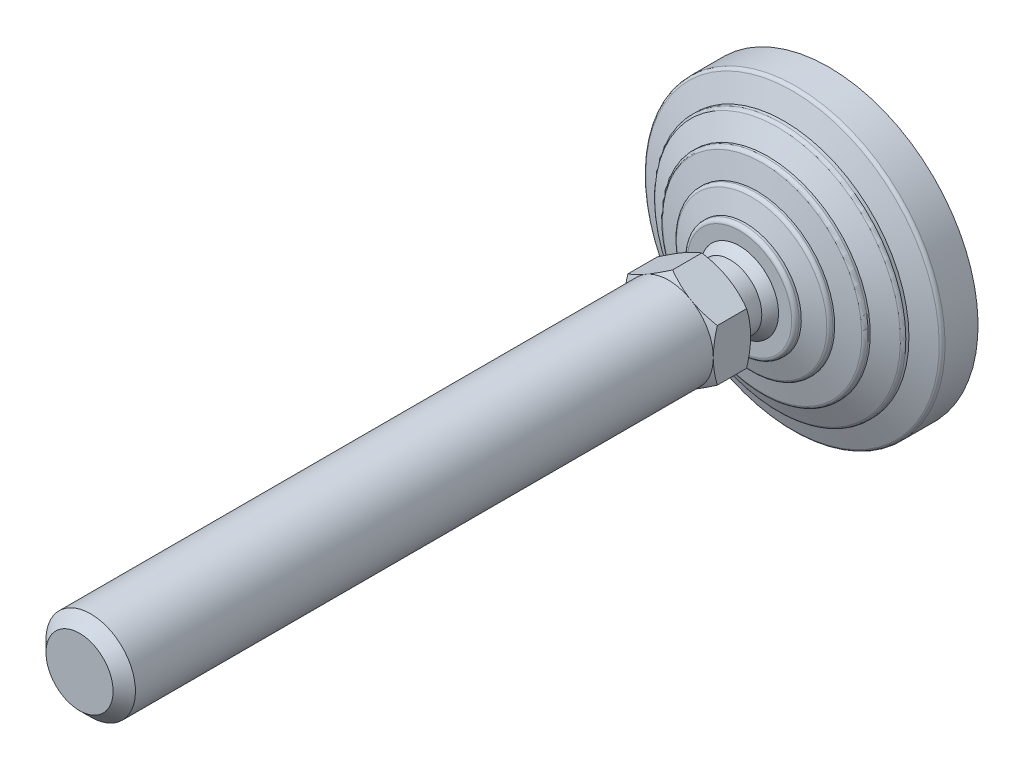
ISO-10303-21;
HEADER;
FILE_DESCRIPTION(('STEP AP214'),'2;1');
FILE_NAME('part.step','',(''),(''),'','','');
FILE_SCHEMA(('AUTOMOTIVE_DESIGN { 1 0 10303 214 1 1 1 1 }'));
ENDSEC;
DATA;
#1=APPLICATION_CONTEXT('core data for automotive mechanical design processes');
#2=APPLICATION_PROTOCOL_DEFINITION('international standard','automotive_design',2000,#1);
#3=PRODUCT_CONTEXT('',#1,'mechanical');
#4=PRODUCT('Part','Part','',(#3));
#5=PRODUCT_RELATED_PRODUCT_CATEGORY('part','',(#4));
#6=PRODUCT_DEFINITION_FORMATION('','',#4);
#7=PRODUCT_DEFINITION_CONTEXT('part definition',#1,'design');
#8=PRODUCT_DEFINITION('design','',#6,#7);
#9=PRODUCT_DEFINITION_SHAPE('','',#8);
#10=(LENGTH_UNIT() NAMED_UNIT(*) SI_UNIT(.MILLI.,.METRE.));
#11=(NAMED_UNIT(*) PLANE_ANGLE_UNIT() SI_UNIT($,.RADIAN.));
#12=(NAMED_UNIT(*) SI_UNIT($,.STERADIAN.) SOLID_ANGLE_UNIT());
#13=UNCERTAINTY_MEASURE_WITH_UNIT(LENGTH_MEASURE(1.E-05),#10,'distance_accuracy_value','');
#14=(GEOMETRIC_REPRESENTATION_CONTEXT(3) GLOBAL_UNCERTAINTY_ASSIGNED_CONTEXT((#13)) GLOBAL_UNIT_ASSIGNED_CONTEXT((#10,
#11,#12)) REPRESENTATION_CONTEXT('',''));
#15=CARTESIAN_POINT('',(0.,0.,0.));
#16=DIRECTION('',(0.,0.,1.));
#17=DIRECTION('',(1.,0.,0.));
#18=AXIS2_PLACEMENT_3D('',#15,#16,#17);
#19=CARTESIAN_POINT('',(-8.4999999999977,0.,32.9999999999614));
#20=DIRECTION('',(0.,0.,1.));
#21=DIRECTION('',(0.,-1.,0.));
#22=AXIS2_PLACEMENT_3D('',#19,#20,#21);
#23=PLANE('',#22);
#24=CARTESIAN_POINT('',(0.,0.,32.9999999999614));
#25=DIRECTION('',(0.,0.,-1.));
#26=DIRECTION('',(0.,1.,0.));
#27=AXIS2_PLACEMENT_3D('',#24,#25,#26);
#28=CIRCLE('',#27,8.4999999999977);
#29=CARTESIAN_POINT('',(0.,8.4999999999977,32.9999999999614));
#30=VERTEX_POINT('',#29);
#31=EDGE_CURVE('E337',#30,#30,#28,.T.);
#32=ORIENTED_EDGE('',*,*,#31,.F.);
#33=EDGE_LOOP('',(#32));
#34=FACE_BOUND('',#33,.T.);
#35=CARTESIAN_POINT('',(0.,0.,32.9999999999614));
#36=DIRECTION('',(0.,0.,-1.));
#37=DIRECTION('',(-1.,0.,0.));
#38=AXIS2_PLACEMENT_3D('',#35,#36,#37);
#39=CIRCLE('',#38,11.9999999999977);
#40=CARTESIAN_POINT('',(6.,10.3923048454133,32.9999999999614));
#41=VERTEX_POINT('',#40);
#42=CARTESIAN_POINT('',(12.,0.,32.9999999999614));
#43=VERTEX_POINT('',#42);
#44=EDGE_CURVE('E493',#41,#43,#39,.T.);
#45=ORIENTED_EDGE('',*,*,#44,.T.);
#46=CARTESIAN_POINT('',(6.,-10.3923048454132,32.9999999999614));
#47=VERTEX_POINT('',#46);
#48=EDGE_CURVE('E140',#43,#47,#39,.T.);
#49=ORIENTED_EDGE('',*,*,#48,.T.);
#50=CARTESIAN_POINT('',(-6.,-10.3923048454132,32.9999999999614));
#51=VERTEX_POINT('',#50);
#52=EDGE_CURVE('E139',#47,#51,#39,.T.);
#53=ORIENTED_EDGE('',*,*,#52,.T.);
#54=CARTESIAN_POINT('',(-12.,0.,32.9999999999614));
#55=VERTEX_POINT('',#54);
#56=EDGE_CURVE('E117',#51,#55,#39,.T.);
#57=ORIENTED_EDGE('',*,*,#56,.T.);
#58=CARTESIAN_POINT('',(-6.,10.3923048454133,32.9999999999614));
#59=VERTEX_POINT('',#58);
#60=EDGE_CURVE('E105',#55,#59,#39,.T.);
#61=ORIENTED_EDGE('',*,*,#60,.T.);
#62=EDGE_CURVE('E34',#59,#41,#39,.T.);
#63=ORIENTED_EDGE('',*,*,#62,.T.);
#64=EDGE_LOOP('',(#45,#49,#53,#57,#61,#63));
#65=FACE_BOUND('',#64,.T.);
#66=ADVANCED_FACE('F14',(#34,#65),#23,.F.);
#67=CARTESIAN_POINT('',(0.,0.,0.));
#68=DIRECTION('',(0.,0.,-1.));
#69=DIRECTION('',(0.,1.,0.));
#70=AXIS2_PLACEMENT_3D('',#67,#68,#69);
#71=CYLINDRICAL_SURFACE('',#70,8.4999999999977);
#72=CARTESIAN_POINT('',(0.,0.,26.4999999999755));
#73=DIRECTION('',(0.,0.,-1.));
#74=DIRECTION('',(0.,1.,0.));
#75=AXIS2_PLACEMENT_3D('',#72,#73,#74);
#76=CIRCLE('',#75,8.4999999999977);
#77=CARTESIAN_POINT('',(0.,8.4999999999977,26.4999999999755));
#78=VERTEX_POINT('',#77);
#79=EDGE_CURVE('E340',#78,#78,#76,.T.);
#80=ORIENTED_EDGE('',*,*,#79,.F.);
#81=EDGE_LOOP('',(#80));
#82=FACE_BOUND('',#81,.T.);
#83=ORIENTED_EDGE('',*,*,#31,.T.);
#84=EDGE_LOOP('',(#83));
#85=FACE_BOUND('',#84,.T.);
#86=ADVANCED_FACE('F305',(#82,#85),#71,.T.);
#87=CARTESIAN_POINT('',(-8.4999999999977,0.,26.4999999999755));
#88=DIRECTION('',(0.,0.,1.));
#89=DIRECTION('',(0.,-1.,0.));
#90=AXIS2_PLACEMENT_3D('',#87,#88,#89);
#91=PLANE('',#90);
#92=CARTESIAN_POINT('',(0.,0.,26.4999999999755));
#93=DIRECTION('',(0.,0.,-1.));
#94=DIRECTION('',(0.,1.,0.));
#95=AXIS2_PLACEMENT_3D('',#92,#93,#94);
#96=CIRCLE('',#95,8.49107182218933);
#97=CARTESIAN_POINT('',(-8.49107182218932,0.,26.4999999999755));
#98=VERTEX_POINT('',#97);
#99=EDGE_CURVE('E343',#98,#98,#96,.T.);
#100=ORIENTED_EDGE('',*,*,#99,.F.);
#101=EDGE_LOOP('',(#100));
#102=FACE_BOUND('',#101,.T.);
#103=ORIENTED_EDGE('',*,*,#79,.T.);
#104=EDGE_LOOP('',(#103));
#105=FACE_BOUND('',#104,.T.);
#106=ADVANCED_FACE('F301',(#102,#105),#91,.F.);
#107=CARTESIAN_POINT('',(-2.80331313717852E-12,0.,17.6702661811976));
#108=DIRECTION('',(0.,0.,-1.));
#109=DIRECTION('',(-1.,0.,0.));
#110=AXIS2_PLACEMENT_3D('',#107,#108,#109);
#111=SPHERICAL_SURFACE('',#110,12.25);
#112=CARTESIAN_POINT('',(0.,0.,24.));
#113=DIRECTION('',(0.,0.,-1.));
#114=DIRECTION('',(0.,1.,0.));
#115=AXIS2_PLACEMENT_3D('',#112,#113,#114);
#116=CIRCLE('',#115,10.4879440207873);
#117=CARTESIAN_POINT('',(-10.4879440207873,0.,24.));
#118=VERTEX_POINT('',#117);
#119=EDGE_CURVE('E346',#118,#118,#116,.T.);
#120=CARTESIAN_POINT('',(-10.4879440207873,0.,24.));
#121=CARTESIAN_POINT('',(-10.4706730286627,0.,24.0286168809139));
#122=CARTESIAN_POINT('',(-10.4532849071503,0.,24.0571630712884));
#123=CARTESIAN_POINT('',(-10.4182755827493,0.,24.1141121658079));
#124=CARTESIAN_POINT('',(-10.4006543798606,0.,24.1425150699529));
#125=CARTESIAN_POINT('',(-10.3651800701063,0.,24.1991756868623));
#126=CARTESIAN_POINT('',(-10.3473269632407,0.,24.2274333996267));
#127=CARTESIAN_POINT('',(-10.3113900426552,0.,24.283801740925));
#128=CARTESIAN_POINT('',(-10.2933062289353,0.,24.3119123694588));
#129=CARTESIAN_POINT('',(-10.2569091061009,0.,24.367984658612));
#130=CARTESIAN_POINT('',(-10.2385957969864,0.,24.3959463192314));
#131=CARTESIAN_POINT('',(-10.2017409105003,0.,24.4517187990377));
#132=CARTESIAN_POINT('',(-10.1831993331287,0.,24.4795296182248));
#133=CARTESIAN_POINT('',(-10.1458891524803,0.,24.5349985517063));
#134=CARTESIAN_POINT('',(-10.1271205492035,0.,24.5626566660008));
#135=CARTESIAN_POINT('',(-10.0893575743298,0.,24.6178183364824));
#136=CARTESIAN_POINT('',(-10.0703632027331,0.,24.6453218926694));
#137=CARTESIAN_POINT('',(-10.0321499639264,0.,24.7001726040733));
#138=CARTESIAN_POINT('',(-10.0129310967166,0.,24.7275197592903));
#139=CARTESIAN_POINT('',(-9.97427015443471,0.,24.7820558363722));
#140=CARTESIAN_POINT('',(-9.95482807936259,0.,24.8092447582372));
#141=CARTESIAN_POINT('',(-9.91572202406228,0.,24.8634625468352));
#142=CARTESIAN_POINT('',(-9.89605804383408,0.,24.8904914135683));
#143=CARTESIAN_POINT('',(-9.85650949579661,0.,24.9443872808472));
#144=CARTESIAN_POINT('',(-9.83662492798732,0.,24.9712542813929));
#145=CARTESIAN_POINT('',(-9.79663653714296,0.,25.0248246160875));
#146=CARTESIAN_POINT('',(-9.7765327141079,0.,25.0515279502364));
#147=CARTESIAN_POINT('',(-9.73610715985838,0.,25.1047691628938));
#148=CARTESIAN_POINT('',(-9.71578542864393,0.,25.1313070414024));
#149=CARTESIAN_POINT('',(-9.67492541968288,0.,25.1842155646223));
#150=CARTESIAN_POINT('',(-9.65438714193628,0.,25.2105862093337));
#151=CARTESIAN_POINT('',(-9.61309541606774,0.,25.2631584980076));
#152=CARTESIAN_POINT('',(-9.5923419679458,0.,25.2893601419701));
#153=CARTESIAN_POINT('',(-9.55062129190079,0.,25.3415926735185));
#154=CARTESIAN_POINT('',(-9.52965406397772,0.,25.3676235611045));
#155=CARTESIAN_POINT('',(-9.48750723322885,0.,25.4195128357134));
#156=CARTESIAN_POINT('',(-9.46632763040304,0.,25.4453712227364));
#157=CARTESIAN_POINT('',(-9.42375746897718,0.,25.4969137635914));
#158=CARTESIAN_POINT('',(-9.40236691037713,0.,25.5225979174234));
#159=CARTESIAN_POINT('',(-9.35937627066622,0.,25.5737902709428));
#160=CARTESIAN_POINT('',(-9.33777618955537,0.,25.5992984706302));
#161=CARTESIAN_POINT('',(-9.29436795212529,0.,25.6501372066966));
#162=CARTESIAN_POINT('',(-9.27255979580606,0.,25.6754677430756));
#163=CARTESIAN_POINT('',(-9.2287368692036,0.,25.7259494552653));
#164=CARTESIAN_POINT('',(-9.20672209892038,0.,25.7511006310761));
#165=CARTESIAN_POINT('',(-9.16248741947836,0.,25.8012219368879));
#166=CARTESIAN_POINT('',(-9.14026751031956,0.,25.8261920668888));
#167=CARTESIAN_POINT('',(-9.09562404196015,0.,25.8759496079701));
#168=CARTESIAN_POINT('',(-9.07320048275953,0.,25.9007370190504));
#169=CARTESIAN_POINT('',(-9.02815121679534,0.,25.9501274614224));
#170=CARTESIAN_POINT('',(-9.00552551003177,0.,25.974730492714));
#171=CARTESIAN_POINT('',(-8.96007346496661,0.,26.0237505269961));
#172=CARTESIAN_POINT('',(-8.93724712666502,0.,26.0481675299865));
#173=CARTESIAN_POINT('',(-8.89139534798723,0.,26.0968138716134));
#174=CARTESIAN_POINT('',(-8.86836990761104,0.,26.1210432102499));
#175=CARTESIAN_POINT('',(-8.82212146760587,0.,26.1693125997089));
#176=CARTESIAN_POINT('',(-8.7988984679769,0.,26.1933526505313));
#177=CARTESIAN_POINT('',(-8.75225646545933,0.,26.2412418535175));
#178=CARTESIAN_POINT('',(-8.72883746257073,0.,26.2650910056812));
#179=CARTESIAN_POINT('',(-8.68180502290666,0.,26.3125968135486));
#180=CARTESIAN_POINT('',(-8.6581915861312,0.,26.3362534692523));
#181=CARTESIAN_POINT('',(-8.61077186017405,0.,26.3833726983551));
#182=CARTESIAN_POINT('',(-8.58696557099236,0.,26.4068352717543));
#183=CARTESIAN_POINT('',(-8.53916173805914,0.,26.4535647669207));
#184=CARTESIAN_POINT('',(-8.5151641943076,0.,26.4768316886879));
#185=CARTESIAN_POINT('',(-8.49107182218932,0.,26.4999999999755));
#186=B_SPLINE_CURVE_WITH_KNOTS('',3,(#120,#121,#122,#123,#124,#125,#126,#127,#128,#129,#130,
#131,#132,#133,#134,#135,#136,#137,#138,#139,#140,#141,#142,#143,#144,#145,#146,#147,#148,#149,
#150,#151,#152,#153,#154,#155,#156,#157,#158,#159,#160,#161,#162,#163,#164,#165,#166,#167,#168,
#169,#170,#171,#172,#173,#174,#175,#176,#177,#178,#179,#180,#181,#182,#183,#184,#185),
.UNSPECIFIED.,.F.,.F.,(4,2,2,2,2,2,2,2,2,2,2,2,2,2,2,2,2,2,2,2,2,2,2,2,2,2,2,2,2,2,2,2,4),(0.,
0.100273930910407,0.200547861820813,0.300821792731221,0.401095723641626,0.501369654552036,
0.601643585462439,0.701917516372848,0.802191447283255,0.902465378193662,1.00273930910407,
1.10301324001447,1.20328717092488,1.30356110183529,1.4038350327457,1.5041089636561,
1.60438289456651,1.70465682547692,1.80493075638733,1.90520468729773,2.00547861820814,
2.10575254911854,2.20602648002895,2.30630041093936,2.40657434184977,2.50684827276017,
2.60712220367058,2.70739613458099,2.80767006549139,2.9079439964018,3.00821792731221,
3.10849185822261,3.20876578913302),.UNSPECIFIED.);
#187=EDGE_CURVE('BSEAM297',#118,#98,#186,.T.);
#188=ORIENTED_EDGE('',*,*,#119,.F.);
#189=ORIENTED_EDGE('',*,*,#99,.T.);
#190=ORIENTED_EDGE('',*,*,#187,.T.);
#191=ORIENTED_EDGE('',*,*,#187,.F.);
#192=EDGE_LOOP('',(#188,#190,#189,#191));
#193=FACE_BOUND('',#192,.T.);
#194=ADVANCED_FACE('F297',(#193),#111,.T.);
#195=CARTESIAN_POINT('',(-10.4879440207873,0.,24.));
#196=DIRECTION('',(0.,0.,-1.));
#197=DIRECTION('',(0.,1.,0.));
#198=AXIS2_PLACEMENT_3D('',#195,#196,#197);
#199=PLANE('',#198);
#200=CARTESIAN_POINT('',(0.,0.,24.));
#201=DIRECTION('',(0.,0.,-1.));
#202=DIRECTION('',(0.,1.,0.));
#203=AXIS2_PLACEMENT_3D('',#200,#201,#202);
#204=CIRCLE('',#203,13.9999999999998);
#205=CARTESIAN_POINT('',(0.,13.9999999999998,24.));
#206=VERTEX_POINT('',#205);
#207=EDGE_CURVE('E349',#206,#206,#204,.T.);
#208=ORIENTED_EDGE('',*,*,#207,.F.);
#209=EDGE_LOOP('',(#208));
#210=FACE_BOUND('',#209,.T.);
#211=ORIENTED_EDGE('',*,*,#119,.T.);
#212=EDGE_LOOP('',(#211));
#213=FACE_BOUND('',#212,.T.);
#214=ADVANCED_FACE('F293',(#210,#213),#199,.F.);
#215=CARTESIAN_POINT('',(0.,0.,23.));
#216=DIRECTION('',(0.,0.,-1.));
#217=DIRECTION('',(0.,1.,0.));
#218=AXIS2_PLACEMENT_3D('',#215,#216,#217);
#219=TOROIDAL_SURFACE('',#218,13.9999999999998,1.);
#220=CARTESIAN_POINT('',(0.,0.,23.));
#221=DIRECTION('',(0.,0.,-1.));
#222=DIRECTION('',(0.,1.,0.));
#223=AXIS2_PLACEMENT_3D('',#220,#221,#222);
#224=CIRCLE('',#223,14.9999999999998);
#225=CARTESIAN_POINT('',(0.,14.9999999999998,23.));
#226=VERTEX_POINT('',#225);
#227=EDGE_CURVE('E352',#226,#226,#224,.T.);
#228=ORIENTED_EDGE('',*,*,#227,.F.);
#229=EDGE_LOOP('',(#228));
#230=FACE_BOUND('',#229,.T.);
#231=ORIENTED_EDGE('',*,*,#207,.T.);
#232=EDGE_LOOP('',(#231));
#233=FACE_BOUND('',#232,.T.);
#234=ADVANCED_FACE('F289',(#230,#233),#219,.T.);
#235=CARTESIAN_POINT('',(0.,0.,0.));
#236=DIRECTION('',(0.,0.,-1.));
#237=DIRECTION('',(0.,1.,0.));
#238=AXIS2_PLACEMENT_3D('',#235,#236,#237);
#239=CYLINDRICAL_SURFACE('',#238,14.9999999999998);
#240=CARTESIAN_POINT('',(0.,0.,22.4025287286));
#241=DIRECTION('',(0.,0.,-1.));
#242=DIRECTION('',(0.,1.,0.));
#243=AXIS2_PLACEMENT_3D('',#240,#241,#242);
#244=CIRCLE('',#243,14.9999999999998);
#245=CARTESIAN_POINT('',(0.,14.9999999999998,22.4025287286));
#246=VERTEX_POINT('',#245);
#247=EDGE_CURVE('E355',#246,#246,#244,.T.);
#248=ORIENTED_EDGE('',*,*,#247,.F.);
#249=EDGE_LOOP('',(#248));
#250=FACE_BOUND('',#249,.T.);
#251=ORIENTED_EDGE('',*,*,#227,.T.);
#252=EDGE_LOOP('',(#251));
#253=FACE_BOUND('',#252,.T.);
#254=ADVANCED_FACE('F285',(#250,#253),#239,.T.);
#255=CARTESIAN_POINT('',(0.,0.,22.4025287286));
#256=DIRECTION('',(0.,0.,-1.));
#257=DIRECTION('',(0.,1.,0.));
#258=AXIS2_PLACEMENT_3D('',#255,#256,#257);
#259=CONICAL_SURFACE('',#258,14.9999999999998,1.25589726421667);
#260=CARTESIAN_POINT('',(0.,0.,20.7216684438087));
#261=DIRECTION('',(0.,0.,-1.));
#262=DIRECTION('',(0.,1.,0.));
#263=AXIS2_PLACEMENT_3D('',#260,#261,#262);
#264=CIRCLE('',#263,20.1601635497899);
#265=CARTESIAN_POINT('',(0.,20.1601635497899,20.7216684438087));
#266=VERTEX_POINT('',#265);
#267=EDGE_CURVE('E358',#266,#266,#264,.T.);
#268=ORIENTED_EDGE('',*,*,#267,.F.);
#269=EDGE_LOOP('',(#268));
#270=FACE_BOUND('',#269,.T.);
#271=ORIENTED_EDGE('',*,*,#247,.T.);
#272=EDGE_LOOP('',(#271));
#273=FACE_BOUND('',#272,.T.);
#274=ADVANCED_FACE('F281',(#270,#273),#259,.T.);
#275=CARTESIAN_POINT('',(0.,0.,19.7708407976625));
#276=DIRECTION('',(0.,0.,-1.));
#277=DIRECTION('',(0.,1.,0.));
#278=AXIS2_PLACEMENT_3D('',#275,#276,#277);
#279=TOROIDAL_SURFACE('',#278,19.8504430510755,1.);
#280=CARTESIAN_POINT('',(0.,0.,19.7708407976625));
#281=DIRECTION('',(0.,0.,-1.));
#282=DIRECTION('',(0.,1.,0.));
#283=AXIS2_PLACEMENT_3D('',#280,#281,#282);
#284=CIRCLE('',#283,20.8504430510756);
#285=CARTESIAN_POINT('',(0.,20.8504430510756,19.7708407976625));
#286=VERTEX_POINT('',#285);
#287=EDGE_CURVE('E361',#286,#286,#284,.T.);
#288=ORIENTED_EDGE('',*,*,#287,.F.);
#289=EDGE_LOOP('',(#288));
#290=FACE_BOUND('',#289,.T.);
#291=ORIENTED_EDGE('',*,*,#267,.T.);
#292=EDGE_LOOP('',(#291));
#293=FACE_BOUND('',#292,.T.);
#294=ADVANCED_FACE('F277',(#290,#293),#279,.T.);
#295=CARTESIAN_POINT('',(0.,0.,0.));
#296=DIRECTION('',(0.,0.,-1.));
#297=DIRECTION('',(0.,1.,0.));
#298=AXIS2_PLACEMENT_3D('',#295,#296,#297);
#299=CYLINDRICAL_SURFACE('',#298,20.8504430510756);
#300=CARTESIAN_POINT('',(0.,0.,19.2987385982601));
#301=DIRECTION('',(0.,0.,-1.));
#302=DIRECTION('',(0.,1.,0.));
#303=AXIS2_PLACEMENT_3D('',#300,#301,#302);
#304=CIRCLE('',#303,20.8504430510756);
#305=CARTESIAN_POINT('',(0.,20.8504430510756,19.2987385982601));
#306=VERTEX_POINT('',#305);
#307=EDGE_CURVE('E364',#306,#306,#304,.T.);
#308=ORIENTED_EDGE('',*,*,#307,.F.);
#309=EDGE_LOOP('',(#308));
#310=FACE_BOUND('',#309,.T.);
#311=ORIENTED_EDGE('',*,*,#287,.T.);
#312=EDGE_LOOP('',(#311));
#313=FACE_BOUND('',#312,.T.);
#314=ADVANCED_FACE('F273',(#310,#313),#299,.T.);
#315=CARTESIAN_POINT('',(0.,0.,19.2987385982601));
#316=DIRECTION('',(0.,0.,-1.));
#317=DIRECTION('',(0.,1.,0.));
#318=AXIS2_PLACEMENT_3D('',#315,#316,#317);
#319=CONICAL_SURFACE('',#318,20.8504430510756,1.34067144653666);
#320=CARTESIAN_POINT('',(0.,0.,17.9217501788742));
#321=DIRECTION('',(0.,0.,-1.));
#322=DIRECTION('',(0.,1.,0.));
#323=AXIS2_PLACEMENT_3D('',#320,#321,#322);
#324=CIRCLE('',#323,26.7280991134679);
#325=CARTESIAN_POINT('',(0.,26.7280991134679,17.9217501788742));
#326=VERTEX_POINT('',#325);
#327=EDGE_CURVE('E367',#326,#326,#324,.T.);
#328=ORIENTED_EDGE('',*,*,#327,.F.);
#329=EDGE_LOOP('',(#328));
#330=FACE_BOUND('',#329,.T.);
#331=ORIENTED_EDGE('',*,*,#307,.T.);
#332=EDGE_LOOP('',(#331));
#333=FACE_BOUND('',#332,.T.);
#334=ADVANCED_FACE('F269',(#330,#333),#319,.T.);
#335=CARTESIAN_POINT('',(0.,0.,16.9481122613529));
#336=DIRECTION('',(0.,0.,-1.));
#337=DIRECTION('',(0.,1.,0.));
#338=AXIS2_PLACEMENT_3D('',#335,#336,#337);
#339=TOROIDAL_SURFACE('',#338,26.5,1.);
#340=CARTESIAN_POINT('',(0.,0.,16.9481122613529));
#341=DIRECTION('',(0.,0.,-1.));
#342=DIRECTION('',(0.,1.,0.));
#343=AXIS2_PLACEMENT_3D('',#340,#341,#342);
#344=CIRCLE('',#343,27.5);
#345=CARTESIAN_POINT('',(0.,27.5,16.9481122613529));
#346=VERTEX_POINT('',#345);
#347=EDGE_CURVE('E370',#346,#346,#344,.T.);
#348=ORIENTED_EDGE('',*,*,#347,.F.);
#349=EDGE_LOOP('',(#348));
#350=FACE_BOUND('',#349,.T.);
#351=ORIENTED_EDGE('',*,*,#327,.T.);
#352=EDGE_LOOP('',(#351));
#353=FACE_BOUND('',#352,.T.);
#354=ADVANCED_FACE('F265',(#350,#353),#339,.T.);
#355=CARTESIAN_POINT('',(0.,0.,0.));
#356=DIRECTION('',(0.,0.,-1.));
#357=DIRECTION('',(0.,1.,0.));
#358=AXIS2_PLACEMENT_3D('',#355,#356,#357);
#359=CYLINDRICAL_SURFACE('',#358,27.5);
#360=CARTESIAN_POINT('',(0.,0.,16.4025287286));
#361=DIRECTION('',(0.,0.,-1.));
#362=DIRECTION('',(0.,1.,0.));
#363=AXIS2_PLACEMENT_3D('',#360,#361,#362);
#364=CIRCLE('',#363,27.5);
#365=CARTESIAN_POINT('',(0.,27.5,16.4025287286));
#366=VERTEX_POINT('',#365);
#367=EDGE_CURVE('E373',#366,#366,#364,.T.);
#368=ORIENTED_EDGE('',*,*,#367,.F.);
#369=EDGE_LOOP('',(#368));
#370=FACE_BOUND('',#369,.T.);
#371=ORIENTED_EDGE('',*,*,#347,.T.);
#372=EDGE_LOOP('',(#371));
#373=FACE_BOUND('',#372,.T.);
#374=ADVANCED_FACE('F261',(#370,#373),#359,.T.);
#375=CARTESIAN_POINT('',(0.,0.,16.4025287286));
#376=DIRECTION('',(0.,0.,-1.));
#377=DIRECTION('',(0.,1.,0.));
#378=AXIS2_PLACEMENT_3D('',#375,#376,#377);
#379=CONICAL_SURFACE('',#378,27.5,1.12022914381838);
#380=CARTESIAN_POINT('',(0.,0.,13.773091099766));
#381=DIRECTION('',(0.,0.,-1.));
#382=DIRECTION('',(0.,1.,0.));
#383=AXIS2_PLACEMENT_3D('',#380,#381,#382);
#384=CIRCLE('',#383,32.935476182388);
#385=CARTESIAN_POINT('',(0.,32.935476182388,13.773091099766));
#386=VERTEX_POINT('',#385);
#387=EDGE_CURVE('E376',#386,#386,#384,.T.);
#388=ORIENTED_EDGE('',*,*,#387,.F.);
#389=EDGE_LOOP('',(#388));
#390=FACE_BOUND('',#389,.T.);
#391=ORIENTED_EDGE('',*,*,#367,.T.);
#392=EDGE_LOOP('',(#391));
#393=FACE_BOUND('',#392,.T.);
#394=ADVANCED_FACE('F257',(#390,#393),#379,.T.);
#395=CARTESIAN_POINT('',(0.,0.,12.8728908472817));
#396=DIRECTION('',(0.,0.,-1.));
#397=DIRECTION('',(0.,1.,0.));
#398=AXIS2_PLACEMENT_3D('',#395,#396,#397);
#399=TOROIDAL_SURFACE('',#398,32.5,1.);
#400=CARTESIAN_POINT('',(0.,0.,12.8728908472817));
#401=DIRECTION('',(0.,0.,-1.));
#402=DIRECTION('',(0.,1.,0.));
#403=AXIS2_PLACEMENT_3D('',#400,#401,#402);
#404=CIRCLE('',#403,33.5);
#405=CARTESIAN_POINT('',(0.,33.5,12.8728908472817));
#406=VERTEX_POINT('',#405);
#407=EDGE_CURVE('E379',#406,#406,#404,.T.);
#408=ORIENTED_EDGE('',*,*,#407,.F.);
#409=EDGE_LOOP('',(#408));
#410=FACE_BOUND('',#409,.T.);
#411=ORIENTED_EDGE('',*,*,#387,.T.);
#412=EDGE_LOOP('',(#411));
#413=FACE_BOUND('',#412,.T.);
#414=ADVANCED_FACE('F253',(#410,#413),#399,.T.);
#415=CARTESIAN_POINT('',(0.,0.,0.));
#416=DIRECTION('',(0.,0.,-1.));
#417=DIRECTION('',(0.,1.,0.));
#418=AXIS2_PLACEMENT_3D('',#415,#416,#417);
#419=CYLINDRICAL_SURFACE('',#418,33.5);
#420=CARTESIAN_POINT('',(0.,0.,12.0315037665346));
#421=DIRECTION('',(0.,0.,-1.));
#422=DIRECTION('',(0.,1.,0.));
#423=AXIS2_PLACEMENT_3D('',#420,#421,#422);
#424=CIRCLE('',#423,33.5);
#425=CARTESIAN_POINT('',(0.,33.5,12.0315037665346));
#426=VERTEX_POINT('',#425);
#427=EDGE_CURVE('E382',#426,#426,#424,.T.);
#428=ORIENTED_EDGE('',*,*,#427,.F.);
#429=EDGE_LOOP('',(#428));
#430=FACE_BOUND('',#429,.T.);
#431=ORIENTED_EDGE('',*,*,#407,.T.);
#432=EDGE_LOOP('',(#431));
#433=FACE_BOUND('',#432,.T.);
#434=ADVANCED_FACE('F249',(#430,#433),#419,.T.);
#435=CARTESIAN_POINT('',(0.,0.,12.0315037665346));
#436=DIRECTION('',(0.,0.,-1.));
#437=DIRECTION('',(0.,1.,0.));
#438=AXIS2_PLACEMENT_3D('',#435,#436,#437);
#439=CONICAL_SURFACE('',#438,33.5,1.20362249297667);
#440=CARTESIAN_POINT('',(0.,0.,9.77805027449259));
#441=DIRECTION('',(0.,0.,-1.));
#442=DIRECTION('',(0.,1.,0.));
#443=AXIS2_PLACEMENT_3D('',#440,#441,#442);
#444=CIRCLE('',#443,39.3589790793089);
#445=CARTESIAN_POINT('',(0.,39.3589790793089,9.77805027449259));
#446=VERTEX_POINT('',#445);
#447=EDGE_CURVE('E385',#446,#446,#444,.T.);
#448=ORIENTED_EDGE('',*,*,#447,.F.);
#449=EDGE_LOOP('',(#448));
#450=FACE_BOUND('',#449,.T.);
#451=ORIENTED_EDGE('',*,*,#427,.T.);
#452=EDGE_LOOP('',(#451));
#453=FACE_BOUND('',#452,.T.);
#454=ADVANCED_FACE('F245',(#450,#453),#439,.T.);
#455=CARTESIAN_POINT('',(0.,0.,8.84470466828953));
#456=DIRECTION('',(0.,0.,-1.));
#457=DIRECTION('',(0.,1.,0.));
#458=AXIS2_PLACEMENT_3D('',#455,#456,#457);
#459=TOROIDAL_SURFACE('',#458,39.,1.);
#460=CARTESIAN_POINT('',(0.,0.,8.84470466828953));
#461=DIRECTION('',(0.,0.,-1.));
#462=DIRECTION('',(0.,1.,0.));
#463=AXIS2_PLACEMENT_3D('',#460,#461,#462);
#464=CIRCLE('',#463,40.);
#465=CARTESIAN_POINT('',(0.,40.,8.84470466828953));
#466=VERTEX_POINT('',#465);
#467=EDGE_CURVE('E388',#466,#466,#464,.T.);
#468=ORIENTED_EDGE('',*,*,#467,.F.);
#469=EDGE_LOOP('',(#468));
#470=FACE_BOUND('',#469,.T.);
#471=ORIENTED_EDGE('',*,*,#447,.T.);
#472=EDGE_LOOP('',(#471));
#473=FACE_BOUND('',#472,.T.);
#474=ADVANCED_FACE('F241',(#470,#473),#459,.T.);
#475=CARTESIAN_POINT('',(0.,0.,0.));
#476=DIRECTION('',(0.,0.,-1.));
#477=DIRECTION('',(0.,1.,0.));
#478=AXIS2_PLACEMENT_3D('',#475,#476,#477);
#479=CYLINDRICAL_SURFACE('',#478,40.);
#480=CARTESIAN_POINT('',(0.,0.,0.));
#481=DIRECTION('',(0.,0.,-1.));
#482=DIRECTION('',(0.,1.,0.));
#483=AXIS2_PLACEMENT_3D('',#480,#481,#482);
#484=CIRCLE('',#483,40.);
#485=CARTESIAN_POINT('',(0.,40.,0.));
#486=VERTEX_POINT('',#485);
#487=EDGE_CURVE('E391',#486,#486,#484,.T.);
#488=ORIENTED_EDGE('',*,*,#487,.F.);
#489=EDGE_LOOP('',(#488));
#490=FACE_BOUND('',#489,.T.);
#491=ORIENTED_EDGE('',*,*,#467,.T.);
#492=EDGE_LOOP('',(#491));
#493=FACE_BOUND('',#492,.T.);
#494=ADVANCED_FACE('F237',(#490,#493),#479,.T.);
#495=CARTESIAN_POINT('',(0.,0.,0.));
#496=DIRECTION('',(0.,0.,1.));
#497=DIRECTION('',(0.,-1.,0.));
#498=AXIS2_PLACEMENT_3D('',#495,#496,#497);
#499=PLANE('',#498);
#500=ORIENTED_EDGE('',*,*,#487,.T.);
#501=EDGE_LOOP('',(#500));
#502=FACE_BOUND('',#501,.T.);
#503=ADVANCED_FACE('F233',(#502),#499,.F.);
#504=CARTESIAN_POINT('',(0.,0.,36.2581637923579));
#505=DIRECTION('',(0.,0.,1.));
#506=DIRECTION('',(1.,0.,0.));
#507=AXIS2_PLACEMENT_3D('',#504,#505,#506);
#508=CONICAL_SURFACE('',#507,17.6433052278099,1.0471975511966);
#509=CARTESIAN_POINT('',(12.,-18.679606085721,38.8901128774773));
#510=CARTESIAN_POINT('',(12.,-18.4172681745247,38.7626839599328));
#511=CARTESIAN_POINT('',(12.,-18.1546243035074,38.6358852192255));
#512=CARTESIAN_POINT('',(12.,-17.6286608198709,38.3836906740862));
#513=CARTESIAN_POINT('',(12.,-17.36534120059,38.2582948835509));
#514=CARTESIAN_POINT('',(12.,-16.5742038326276,37.8843932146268));
#515=CARTESIAN_POINT('',(12.,-16.0452840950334,37.6382103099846));
#516=CARTESIAN_POINT('',(12.,-14.981083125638,37.1522039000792));
#517=CARTESIAN_POINT('',(12.,-14.4457829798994,36.9124217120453));
#518=CARTESIAN_POINT('',(12.,-13.3709501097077,36.4425731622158));
#519=CARTESIAN_POINT('',(12.,-12.8314175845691,36.2125063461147));
#520=CARTESIAN_POINT('',(12.,-11.7295547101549,35.757342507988));
#521=CARTESIAN_POINT('',(12.,-11.1670551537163,35.5326529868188));
#522=CARTESIAN_POINT('',(12.,-10.0354968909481,35.1001104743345));
#523=CARTESIAN_POINT('',(12.,-9.46643746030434,34.8922593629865));
#524=CARTESIAN_POINT('',(12.,-8.32191542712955,34.4988025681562));
#525=CARTESIAN_POINT('',(12.,-7.74646822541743,34.3131524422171));
#526=CARTESIAN_POINT('',(12.,-6.58726493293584,33.9699981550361));
#527=CARTESIAN_POINT('',(12.,-6.00351149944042,33.8124852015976));
#528=CARTESIAN_POINT('',(12.,-5.12316892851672,33.603417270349));
#529=CARTESIAN_POINT('',(12.,-4.82975685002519,33.5384046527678));
#530=CARTESIAN_POINT('',(12.,-4.24091493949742,33.418213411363));
#531=CARTESIAN_POINT('',(12.,-3.94548514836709,33.3630345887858));
#532=CARTESIAN_POINT('',(12.,-3.35280631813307,33.2634805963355));
#533=CARTESIAN_POINT('',(12.,-3.05555730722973,33.2191052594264));
#534=CARTESIAN_POINT('',(12.,-2.45954943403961,33.1420408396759));
#535=CARTESIAN_POINT('',(12.,-2.16079063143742,33.1093512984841));
#536=CARTESIAN_POINT('',(12.,-1.56611144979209,33.0567216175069));
#537=CARTESIAN_POINT('',(12.,-1.27020552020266,33.036619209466));
#538=CARTESIAN_POINT('',(12.,-0.677809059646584,33.0089497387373));
#539=CARTESIAN_POINT('',(12.,-0.381318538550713,33.001382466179));
#540=CARTESIAN_POINT('',(12.,0.211717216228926,32.9989635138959));
#541=CARTESIAN_POINT('',(12.,0.508262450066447,33.004111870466));
#542=CARTESIAN_POINT('',(12.,1.10087013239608,33.0269977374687));
#543=CARTESIAN_POINT('',(12.,1.39693255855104,33.0447358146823));
#544=CARTESIAN_POINT('',(12.,2.10637063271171,33.1019468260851));
#545=CARTESIAN_POINT('',(12.,2.51928240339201,33.1472768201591));
#546=CARTESIAN_POINT('',(12.,3.34208957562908,33.2599731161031));
#547=CARTESIAN_POINT('',(12.,3.75198456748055,33.3273423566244));
#548=CARTESIAN_POINT('',(12.,4.56835128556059,33.4817207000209));
#549=CARTESIAN_POINT('',(12.,4.97482012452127,33.568744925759));
#550=CARTESIAN_POINT('',(12.,5.78370395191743,33.7597735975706));
#551=CARTESIAN_POINT('',(12.,6.18611899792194,33.8637778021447));
#552=CARTESIAN_POINT('',(12.,6.99577336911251,34.0886974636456));
#553=CARTESIAN_POINT('',(12.,7.40292220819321,34.2099363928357));
#554=CARTESIAN_POINT('',(12.,8.21321004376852,34.4650775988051));
#555=CARTESIAN_POINT('',(12.,8.61634901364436,34.5989799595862));
#556=CARTESIAN_POINT('',(12.,9.41881381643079,34.8773100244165));
#557=CARTESIAN_POINT('',(12.,9.81814083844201,35.021734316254));
#558=CARTESIAN_POINT('',(12.,10.6134770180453,35.3193957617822));
#559=CARTESIAN_POINT('',(12.,11.0094862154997,35.4726328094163));
#560=CARTESIAN_POINT('',(12.,11.9476338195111,35.8457493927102));
#561=CARTESIAN_POINT('',(12.,12.4884556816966,36.0689342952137));
#562=CARTESIAN_POINT('',(12.,13.5654532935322,36.5262783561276));
#563=CARTESIAN_POINT('',(12.,14.1016287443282,36.7604382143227));
#564=CARTESIAN_POINT('',(12.,15.1702039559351,37.2375232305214));
#565=CARTESIAN_POINT('',(12.,15.702602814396,37.4804504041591));
#566=CARTESIAN_POINT('',(12.,16.7641343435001,37.9732912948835));
#567=CARTESIAN_POINT('',(12.,17.2932670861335,38.2232048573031));
#568=CARTESIAN_POINT('',(12.,18.3494032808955,38.7289890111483));
#569=CARTESIAN_POINT('',(12.,18.8764036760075,38.9848659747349));
#570=CARTESIAN_POINT('',(12.,19.9281145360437,39.5012827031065));
#571=CARTESIAN_POINT('',(12.,20.4528249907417,39.761822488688));
#572=CARTESIAN_POINT('',(12.,21.5002396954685,40.2867266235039));
#573=CARTESIAN_POINT('',(12.,22.0229442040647,40.5510904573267));
#574=CARTESIAN_POINT('',(12.,23.0667079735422,41.0830480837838));
#575=CARTESIAN_POINT('',(12.,23.5877672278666,41.3506418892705));
#576=CARTESIAN_POINT('',(12.,25.0606906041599,42.1119277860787));
#577=CARTESIAN_POINT('',(12.,26.0109075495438,42.6088067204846));
#578=CARTESIAN_POINT('',(12.,27.9077996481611,43.6093471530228));
#579=CARTESIAN_POINT('',(12.,28.8544746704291,44.1130088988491));
#580=CARTESIAN_POINT('',(12.,30.7426363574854,45.1242302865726));
#581=CARTESIAN_POINT('',(12.,31.6841300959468,45.631776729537));
#582=CARTESIAN_POINT('',(12.,33.0947018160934,46.3961096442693));
#583=CARTESIAN_POINT('',(12.,33.564601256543,46.6513823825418));
#584=CARTESIAN_POINT('',(12.,34.5039071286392,47.1628316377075));
#585=CARTESIAN_POINT('',(12.,34.9733135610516,47.4190081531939));
#586=CARTESIAN_POINT('',(12.,35.442501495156,47.6755843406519));
#587=B_SPLINE_CURVE_WITH_KNOTS('',3,(#509,#510,#511,#512,#513,#514,#515,#516,#517,#518,#519,
#520,#521,#522,#523,#524,#525,#526,#527,#528,#529,#530,#531,#532,#533,#534,#535,#536,#537,#538,
#539,#540,#541,#542,#543,#544,#545,#546,#547,#548,#549,#550,#551,#552,#553,#554,#555,#556,#557,
#558,#559,#560,#561,#562,#563,#564,#565,#566,#567,#568,#569,#570,#571,#572,#573,#574,#575,#576,
#577,#578,#579,#580,#581,#582,#583,#584,#585,#586),.UNSPECIFIED.,.F.,.F.,(4,2,2,2,2,2,2,2,2,2,2,
2,2,2,2,2,2,2,2,2,2,2,2,2,2,2,2,2,2,2,2,2,2,2,2,2,2,2,4),(0.,0.874946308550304,1.74990127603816,
3.50006654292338,5.25964343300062,7.01913795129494,8.836078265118,10.6532211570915,
12.4666632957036,14.2795377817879,15.1809846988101,16.0824133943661,16.9838281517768,
17.8852075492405,18.7747136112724,19.6642047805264,20.5536984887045,21.4432322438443,
22.6887221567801,23.9343782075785,25.1809959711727,26.4275960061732,27.7017996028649,
28.976011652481,30.2498123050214,31.5235976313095,33.2786243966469,35.0337632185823,
36.7893081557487,38.5448142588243,40.3022910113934,42.0597756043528,43.8170254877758,
45.5742823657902,48.7911039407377,52.0080433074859,55.216787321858,56.8210705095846,
58.4253512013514),.UNSPECIFIED.);
#588=CARTESIAN_POINT('',(12.,6.92820323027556,34.0717967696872));
#589=VERTEX_POINT('',#588);
#590=EDGE_CURVE('E115',#589,#43,#587,.F.);
#591=ORIENTED_EDGE('',*,*,#590,.T.);
#592=ORIENTED_EDGE('',*,*,#44,.F.);
#593=CARTESIAN_POINT('',(-0.00019999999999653,13.8565219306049,34.0718634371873));
#594=CARTESIAN_POINT('',(0.263585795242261,13.7042251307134,33.9839496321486));
#595=CARTESIAN_POINT('',(0.528355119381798,13.5513604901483,33.9000259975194));
#596=CARTESIAN_POINT('',(1.06001701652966,13.2444053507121,33.7412662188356));
#597=CARTESIAN_POINT('',(1.32691025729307,13.0903144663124,33.6664330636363));
#598=CARTESIAN_POINT('',(2.13189040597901,12.6255589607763,33.4570175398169));
#599=CARTESIAN_POINT('',(2.67315507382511,12.3130596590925,33.3379032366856));
#600=CARTESIAN_POINT('',(3.483132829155,11.8454187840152,33.1982310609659));
#601=CARTESIAN_POINT('',(3.74942610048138,11.6916742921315,33.1584437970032));
#602=CARTESIAN_POINT('',(4.28324559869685,11.3834734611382,33.0917233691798));
#603=CARTESIAN_POINT('',(4.55077184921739,11.2290171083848,33.0647904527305));
#604=CARTESIAN_POINT('',(5.08627036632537,10.9198468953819,33.0244685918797));
#605=CARTESIAN_POINT('',(5.35424172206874,10.7651335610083,33.0110635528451));
#606=CARTESIAN_POINT('',(5.89043273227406,10.4555635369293,32.9980830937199));
#607=CARTESIAN_POINT('',(6.15865237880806,10.3007068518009,32.9985072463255));
#608=CARTESIAN_POINT('',(6.66008937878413,10.0112020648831,33.0122200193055));
#609=CARTESIAN_POINT('',(6.89334249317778,9.87653331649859,33.0238359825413));
#610=CARTESIAN_POINT('',(7.35931224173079,9.60750555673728,33.0573080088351));
#611=CARTESIAN_POINT('',(7.59202883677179,9.47314656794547,33.079164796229));
#612=CARTESIAN_POINT('',(8.05679907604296,9.20481134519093,33.1327374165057));
#613=CARTESIAN_POINT('',(8.28885201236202,9.07083551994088,33.1644613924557));
#614=CARTESIAN_POINT('',(8.75186996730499,8.80351197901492,33.2372117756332));
#615=CARTESIAN_POINT('',(8.98283491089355,8.6701643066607,33.2782388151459));
#616=CARTESIAN_POINT('',(9.68394195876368,8.26537996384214,33.4163116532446));
#617=CARTESIAN_POINT('',(10.1520537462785,7.9951154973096,33.5271248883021));
#618=CARTESIAN_POINT('',(11.0812971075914,7.45861659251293,33.7786257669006));
#619=CARTESIAN_POINT('',(11.5424405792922,7.19237528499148,33.9192543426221));
#620=CARTESIAN_POINT('',(12.0002,6.92808776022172,34.0718634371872));
#621=B_SPLINE_CURVE_WITH_KNOTS('',3,(#593,#594,#595,#596,#597,#598,#599,#600,#601,#602,#603,
#604,#605,#606,#607,#608,#609,#610,#611,#612,#613,#614,#615,#616,#617,#618,#619,#620),
.UNSPECIFIED.,.F.,.F.,(4,2,2,2,2,2,2,2,2,2,2,2,2,4),(0.,0.95100487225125,1.90232158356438,
3.8090046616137,4.73894551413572,5.66890426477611,6.59775529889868,7.52657763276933,
8.33514643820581,9.14377244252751,9.95306755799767,10.7624176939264,12.4167102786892,
14.0677556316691),.UNSPECIFIED.);
#622=EDGE_CURVE('E18',#41,#589,#621,.T.);
#623=ORIENTED_EDGE('',*,*,#622,.T.);
#624=EDGE_LOOP('',(#591,#592,#623));
#625=FACE_BOUND('',#624,.T.);
#626=ADVANCED_FACE('F157',(#625),#508,.T.);
#627=CARTESIAN_POINT('',(-12.0002,6.92808776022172,34.0718634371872));
#628=CARTESIAN_POINT('',(-11.7364142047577,7.08038456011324,33.9839496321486));
#629=CARTESIAN_POINT('',(-11.4716448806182,7.23324920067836,33.9000259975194));
#630=CARTESIAN_POINT('',(-10.9399829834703,7.54020434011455,33.7412662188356));
#631=CARTESIAN_POINT('',(-10.6730897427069,7.69429522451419,33.6664330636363));
#632=CARTESIAN_POINT('',(-9.86810959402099,8.15905073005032,33.4570175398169));
#633=CARTESIAN_POINT('',(-9.32684492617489,8.4715500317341,33.3379032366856));
#634=CARTESIAN_POINT('',(-8.51686717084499,8.93919090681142,33.1982310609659));
#635=CARTESIAN_POINT('',(-8.25057389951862,9.09293539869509,33.1584437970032));
#636=CARTESIAN_POINT('',(-7.71675440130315,9.40113622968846,33.0917233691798));
#637=CARTESIAN_POINT('',(-7.44922815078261,9.55559258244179,33.0647904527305));
#638=CARTESIAN_POINT('',(-6.91372963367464,9.86476279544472,33.0244685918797));
#639=CARTESIAN_POINT('',(-6.64575827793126,10.0194761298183,33.0110635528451));
#640=CARTESIAN_POINT('',(-6.10956726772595,10.3290461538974,32.9980830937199));
#641=CARTESIAN_POINT('',(-5.84134762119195,10.4839028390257,32.9985072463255));
#642=CARTESIAN_POINT('',(-5.33991062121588,10.7734076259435,33.0122200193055));
#643=CARTESIAN_POINT('',(-5.10665750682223,10.908076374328,33.0238359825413));
#644=CARTESIAN_POINT('',(-4.64068775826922,11.1771041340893,33.0573080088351));
#645=CARTESIAN_POINT('',(-4.40797116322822,11.3114631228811,33.079164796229));
#646=CARTESIAN_POINT('',(-3.94320092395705,11.5797983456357,33.1327374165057));
#647=CARTESIAN_POINT('',(-3.71114798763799,11.7137741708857,33.1644613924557));
#648=CARTESIAN_POINT('',(-3.24813003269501,11.9810977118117,33.2372117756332));
#649=CARTESIAN_POINT('',(-3.01716508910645,12.1144453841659,33.278238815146));
#650=CARTESIAN_POINT('',(-2.31605804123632,12.5192297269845,33.4163116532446));
#651=CARTESIAN_POINT('',(-1.84794625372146,12.789494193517,33.5271248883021));
#652=CARTESIAN_POINT('',(-0.918702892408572,13.3259930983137,33.7786257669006));
#653=CARTESIAN_POINT('',(-0.457559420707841,13.5922344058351,33.9192543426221));
#654=CARTESIAN_POINT('',(0.000200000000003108,13.8565219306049,34.0718634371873));
#655=B_SPLINE_CURVE_WITH_KNOTS('',3,(#627,#628,#629,#630,#631,#632,#633,#634,#635,#636,#637,
#638,#639,#640,#641,#642,#643,#644,#645,#646,#647,#648,#649,#650,#651,#652,#653,#654),
.UNSPECIFIED.,.F.,.F.,(4,2,2,2,2,2,2,2,2,2,2,2,2,4),(0.,0.951004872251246,1.90232158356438,
3.80900466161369,4.73894551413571,5.6689042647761,6.59775529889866,7.52657763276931,
8.33514643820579,9.1437724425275,9.95306755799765,10.7624176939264,12.4167102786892,
14.0677556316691),.UNSPECIFIED.);
#656=CARTESIAN_POINT('',(0.,13.8564064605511,34.0717967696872));
#657=VERTEX_POINT('',#656);
#658=EDGE_CURVE('E149',#59,#657,#655,.T.);
#659=ORIENTED_EDGE('',*,*,#658,.T.);
#660=EDGE_CURVE('E9',#657,#41,#621,.T.);
#661=ORIENTED_EDGE('',*,*,#660,.T.);
#662=ORIENTED_EDGE('',*,*,#62,.F.);
#663=EDGE_LOOP('',(#659,#661,#662));
#664=FACE_BOUND('',#663,.T.);
#665=ADVANCED_FACE('F486',(#664),#508,.T.);
#666=CARTESIAN_POINT('',(12.0002,-6.92808776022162,34.0718634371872));
#667=CARTESIAN_POINT('',(11.7364142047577,-7.08038456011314,33.9839496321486));
#668=CARTESIAN_POINT('',(11.4716448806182,-7.23324920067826,33.9000259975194));
#669=CARTESIAN_POINT('',(10.9399829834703,-7.54020434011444,33.7412662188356));
#670=CARTESIAN_POINT('',(10.6730897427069,-7.69429522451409,33.6664330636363));
#671=CARTESIAN_POINT('',(9.868109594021,-8.15905073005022,33.4570175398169));
#672=CARTESIAN_POINT('',(9.32684492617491,-8.47155003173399,33.3379032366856));
#673=CARTESIAN_POINT('',(8.51686717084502,-8.93919090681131,33.1982310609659));
#674=CARTESIAN_POINT('',(8.25057389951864,-9.09293539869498,33.1584437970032));
#675=CARTESIAN_POINT('',(7.71675440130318,-9.40113622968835,33.0917233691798));
#676=CARTESIAN_POINT('',(7.44922815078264,-9.55559258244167,33.0647904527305));
#677=CARTESIAN_POINT('',(6.91372963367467,-9.86476279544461,33.0244685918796));
#678=CARTESIAN_POINT('',(6.64575827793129,-10.0194761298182,33.011063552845));
#679=CARTESIAN_POINT('',(6.10956726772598,-10.3290461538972,32.9980830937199));
#680=CARTESIAN_POINT('',(5.84134762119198,-10.4839028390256,32.9985072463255));
#681=CARTESIAN_POINT('',(5.33991062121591,-10.7734076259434,33.0122200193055));
#682=CARTESIAN_POINT('',(5.10665750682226,-10.9080763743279,33.0238359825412));
#683=CARTESIAN_POINT('',(4.64068775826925,-11.1771041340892,33.0573080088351));
#684=CARTESIAN_POINT('',(4.40797116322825,-11.311463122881,33.0791647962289));
#685=CARTESIAN_POINT('',(3.94320092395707,-11.5797983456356,33.1327374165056));
#686=CARTESIAN_POINT('',(3.71114798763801,-11.7137741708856,33.1644613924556));
#687=CARTESIAN_POINT('',(3.24813003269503,-11.9810977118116,33.2372117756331));
#688=CARTESIAN_POINT('',(3.01716508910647,-12.1144453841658,33.2782388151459));
#689=CARTESIAN_POINT('',(2.31605804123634,-12.5192297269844,33.4163116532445));
#690=CARTESIAN_POINT('',(1.84794625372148,-12.7894941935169,33.527124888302));
#691=CARTESIAN_POINT('',(0.918702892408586,-13.3259930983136,33.7786257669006));
#692=CARTESIAN_POINT('',(0.45755942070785,-13.592234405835,33.9192543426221));
#693=CARTESIAN_POINT('',(-0.0002000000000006,-13.8565219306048,34.0718634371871));
#694=B_SPLINE_CURVE_WITH_KNOTS('',3,(#666,#667,#668,#669,#670,#671,#672,#673,#674,#675,#676,
#677,#678,#679,#680,#681,#682,#683,#684,#685,#686,#687,#688,#689,#690,#691,#692,#693),
.UNSPECIFIED.,.F.,.F.,(4,2,2,2,2,2,2,2,2,2,2,2,2,4),(0.,0.951004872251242,1.90232158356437,
3.80900466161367,4.73894551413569,5.66890426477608,6.59775529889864,7.52657763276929,
8.33514643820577,9.14377244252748,9.95306755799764,10.7624176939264,12.4167102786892,
14.0677556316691),.UNSPECIFIED.);
#695=CARTESIAN_POINT('',(12.,-6.92820323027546,34.0717967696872));
#696=VERTEX_POINT('',#695);
#697=EDGE_CURVE('E135',#696,#47,#694,.T.);
#698=ORIENTED_EDGE('',*,*,#697,.T.);
#699=ORIENTED_EDGE('',*,*,#48,.F.);
#700=EDGE_CURVE('E150',#43,#696,#587,.F.);
#701=ORIENTED_EDGE('',*,*,#700,.T.);
#702=EDGE_LOOP('',(#698,#699,#701));
#703=FACE_BOUND('',#702,.T.);
#704=ADVANCED_FACE('F480',(#703),#508,.T.);
#705=CARTESIAN_POINT('',(0.000199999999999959,-13.8565219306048,34.0718634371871));
#706=CARTESIAN_POINT('',(-0.263585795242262,-13.7042251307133,33.9839496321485));
#707=CARTESIAN_POINT('',(-0.528355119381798,-13.5513604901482,33.9000259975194));
#708=CARTESIAN_POINT('',(-1.06001701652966,-13.244405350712,33.7412662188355));
#709=CARTESIAN_POINT('',(-1.32691025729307,-13.0903144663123,33.6664330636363));
#710=CARTESIAN_POINT('',(-2.131890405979,-12.6255589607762,33.4570175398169));
#711=CARTESIAN_POINT('',(-2.67315507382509,-12.3130596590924,33.3379032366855));
#712=CARTESIAN_POINT('',(-3.48313282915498,-11.8454187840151,33.1982310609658));
#713=CARTESIAN_POINT('',(-3.74942610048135,-11.6916742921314,33.1584437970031));
#714=CARTESIAN_POINT('',(-4.28324559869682,-11.3834734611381,33.0917233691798));
#715=CARTESIAN_POINT('',(-4.55077184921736,-11.2290171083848,33.0647904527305));
#716=CARTESIAN_POINT('',(-5.08627036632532,-10.9198468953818,33.0244685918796));
#717=CARTESIAN_POINT('',(-5.3542417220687,-10.7651335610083,33.011063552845));
#718=CARTESIAN_POINT('',(-5.89043273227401,-10.4555635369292,32.9980830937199));
#719=CARTESIAN_POINT('',(-6.15865237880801,-10.3007068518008,32.9985072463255));
#720=CARTESIAN_POINT('',(-6.66008937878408,-10.011202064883,33.0122200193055));
#721=CARTESIAN_POINT('',(-6.89334249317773,-9.87653331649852,33.0238359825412));
#722=CARTESIAN_POINT('',(-7.35931224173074,-9.60750555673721,33.0573080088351));
#723=CARTESIAN_POINT('',(-7.59202883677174,-9.47314656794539,33.0791647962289));
#724=CARTESIAN_POINT('',(-8.05679907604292,-9.20481134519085,33.1327374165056));
#725=CARTESIAN_POINT('',(-8.28885201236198,-9.0708355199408,33.1644613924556));
#726=CARTESIAN_POINT('',(-8.75186996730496,-8.80351197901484,33.2372117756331));
#727=CARTESIAN_POINT('',(-8.98283491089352,-8.67016430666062,33.2782388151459));
#728=CARTESIAN_POINT('',(-9.68394195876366,-8.26537996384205,33.4163116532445));
#729=CARTESIAN_POINT('',(-10.1520537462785,-7.99511549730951,33.527124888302));
#730=CARTESIAN_POINT('',(-11.0812971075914,-7.45861659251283,33.7786257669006));
#731=CARTESIAN_POINT('',(-11.5424405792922,-7.19237528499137,33.9192543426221));
#732=CARTESIAN_POINT('',(-12.0002,-6.92808776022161,34.0718634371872));
#733=B_SPLINE_CURVE_WITH_KNOTS('',3,(#705,#706,#707,#708,#709,#710,#711,#712,#713,#714,#715,
#716,#717,#718,#719,#720,#721,#722,#723,#724,#725,#726,#727,#728,#729,#730,#731,#732),
.UNSPECIFIED.,.F.,.F.,(4,2,2,2,2,2,2,2,2,2,2,2,2,4),(0.,0.951004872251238,1.90232158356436,
3.80900466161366,4.73894551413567,5.66890426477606,6.59775529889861,7.52657763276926,
8.33514643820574,9.14377244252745,9.95306755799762,10.7624176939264,12.4167102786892,
14.0677556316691),.UNSPECIFIED.);
#734=CARTESIAN_POINT('',(0.,-13.856406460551,34.0717967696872));
#735=VERTEX_POINT('',#734);
#736=EDGE_CURVE('E431',#735,#51,#733,.T.);
#737=ORIENTED_EDGE('',*,*,#736,.T.);
#738=ORIENTED_EDGE('',*,*,#52,.F.);
#739=EDGE_CURVE('E128',#47,#735,#694,.T.);
#740=ORIENTED_EDGE('',*,*,#739,.T.);
#741=EDGE_LOOP('',(#737,#738,#740));
#742=FACE_BOUND('',#741,.T.);
#743=ADVANCED_FACE('F474',(#742),#508,.T.);
#744=CARTESIAN_POINT('',(-12.,-6.92820323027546,34.0717967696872));
#745=VERTEX_POINT('',#744);
#746=EDGE_CURVE('E124',#51,#745,#733,.T.);
#747=ORIENTED_EDGE('',*,*,#746,.T.);
#748=CARTESIAN_POINT('',(-12.,-18.6796060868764,38.8901128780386));
#749=CARTESIAN_POINT('',(-12.,-18.4172681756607,38.7626839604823));
#750=CARTESIAN_POINT('',(-12.,-18.1546243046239,38.6358852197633));
#751=CARTESIAN_POINT('',(-12.,-17.6286608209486,38.3836906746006));
#752=CARTESIAN_POINT('',(-12.,-17.3653412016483,38.2582948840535));
#753=CARTESIAN_POINT('',(-12.,-16.5742038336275,37.8843932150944));
#754=CARTESIAN_POINT('',(-12.,-16.0452840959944,37.6382103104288));
#755=CARTESIAN_POINT('',(-12.,-14.9810831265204,37.1522039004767));
#756=CARTESIAN_POINT('',(-12.,-14.4457829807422,36.9124217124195));
#757=CARTESIAN_POINT('',(-12.,-13.3709501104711,36.4425731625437));
#758=CARTESIAN_POINT('',(-12.,-12.8314175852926,36.2125063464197));
#759=CARTESIAN_POINT('',(-12.,-11.7295547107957,35.7573425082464));
#760=CARTESIAN_POINT('',(-12.,-11.1670551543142,35.5326529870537));
#761=CARTESIAN_POINT('',(-12.,-10.0354968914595,35.1001104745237));
#762=CARTESIAN_POINT('',(-12.,-9.46643746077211,34.8922593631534));
#763=CARTESIAN_POINT('',(-12.,-8.32191542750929,34.4988025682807));
#764=CARTESIAN_POINT('',(-12.,-7.74646822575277,34.3131524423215));
#765=CARTESIAN_POINT('',(-12.,-6.58726493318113,33.9699981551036));
#766=CARTESIAN_POINT('',(-12.,-6.00351149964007,33.8124852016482));
#767=CARTESIAN_POINT('',(-12.,-5.12316892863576,33.6034172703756));
#768=CARTESIAN_POINT('',(-12.,-4.82975685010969,33.5384046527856));
#769=CARTESIAN_POINT('',(-12.,-4.24091493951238,33.4182134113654));
#770=CARTESIAN_POINT('',(-12.,-3.94548514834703,33.3630345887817));
#771=CARTESIAN_POINT('',(-12.,-3.3528063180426,33.263480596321));
#772=CARTESIAN_POINT('',(-12.,-3.05555730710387,33.219105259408));
#773=CARTESIAN_POINT('',(-12.,-2.45954943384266,33.1420408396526));
#774=CARTESIAN_POINT('',(-12.,-2.16079063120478,33.1093512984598));
#775=CARTESIAN_POINT('',(-12.,-1.56611144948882,33.0567216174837));
#776=CARTESIAN_POINT('',(-12.,-1.27020551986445,33.0366192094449));
#777=CARTESIAN_POINT('',(-12.,-0.677809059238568,33.0089497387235));
#778=CARTESIAN_POINT('',(-12.,-0.381318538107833,33.0013824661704));
#779=CARTESIAN_POINT('',(-12.,0.211717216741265,32.9989635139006));
#780=CARTESIAN_POINT('',(-12.,0.508262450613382,33.0041118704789));
#781=CARTESIAN_POINT('',(-12.,1.10087013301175,33.0269977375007));
#782=CARTESIAN_POINT('',(-12.,1.39693255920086,33.0447358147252));
#783=CARTESIAN_POINT('',(-12.,2.10637063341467,33.101946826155));
#784=CARTESIAN_POINT('',(-12.,2.51928240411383,33.1472768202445));
#785=CARTESIAN_POINT('',(-12.,3.34208957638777,33.2599731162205));
#786=CARTESIAN_POINT('',(-12.,3.75198456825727,33.3273423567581));
#787=CARTESIAN_POINT('',(-12.,4.5683512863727,33.4817207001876));
#788=CARTESIAN_POINT('',(-12.,4.97482012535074,33.5687449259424));
#789=CARTESIAN_POINT('',(-12.,5.78370395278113,33.7597735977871));
#790=CARTESIAN_POINT('',(-12.,6.18611899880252,33.8637778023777));
#791=CARTESIAN_POINT('',(-12.,6.99577337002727,34.0886974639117));
#792=CARTESIAN_POINT('',(-12.,7.40292220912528,34.2099363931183));
#793=CARTESIAN_POINT('',(-12.,8.21321004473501,34.4650775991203));
#794=CARTESIAN_POINT('',(-12.,8.61634901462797,34.5989799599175));
#795=CARTESIAN_POINT('',(-12.,9.41881381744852,34.8773100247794));
#796=CARTESIAN_POINT('',(-12.,9.81814083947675,35.0217343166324));
#797=CARTESIAN_POINT('',(-12.,10.613477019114,35.319395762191));
#798=CARTESIAN_POINT('',(-12.,11.0094862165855,35.4726328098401));
#799=CARTESIAN_POINT('',(-12.,11.9476338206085,35.8457493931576));
#800=CARTESIAN_POINT('',(-12.,12.4884556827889,36.0689342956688));
#801=CARTESIAN_POINT('',(-12.,13.565453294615,36.5262783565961));
#802=CARTESIAN_POINT('',(-12.,14.1016287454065,36.7604382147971));
#803=CARTESIAN_POINT('',(-12.,15.170203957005,37.2375232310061));
#804=CARTESIAN_POINT('',(-12.,15.7026028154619,37.4804504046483));
#805=CARTESIAN_POINT('',(-12.,16.7641343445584,37.9732912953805));
#806=CARTESIAN_POINT('',(-12.,17.2932670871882,38.2232048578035));
#807=CARTESIAN_POINT('',(-12.,18.3494032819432,38.7289890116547));
#808=CARTESIAN_POINT('',(-12.,18.8764036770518,38.9848659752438));
#809=CARTESIAN_POINT('',(-12.,19.9281145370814,39.5012827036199));
#810=CARTESIAN_POINT('',(-12.,20.4528249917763,39.7618224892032));
#811=CARTESIAN_POINT('',(-12.,21.500239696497,40.2867266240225));
#812=CARTESIAN_POINT('',(-12.,22.0229442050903,40.5510904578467));
#813=CARTESIAN_POINT('',(-12.,23.0667079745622,41.0830480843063));
#814=CARTESIAN_POINT('',(-12.,23.5877672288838,41.3506418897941));
#815=CARTESIAN_POINT('',(-12.,25.0606906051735,42.1119277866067));
#816=CARTESIAN_POINT('',(-12.,26.0109075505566,42.6088067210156));
#817=CARTESIAN_POINT('',(-12.,27.9077996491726,43.6093471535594));
#818=CARTESIAN_POINT('',(-12.,28.85447467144,44.1130088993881));
#819=CARTESIAN_POINT('',(-12.,30.7426363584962,45.1242302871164));
#820=CARTESIAN_POINT('',(-12.,31.684130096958,45.6317767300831));
#821=CARTESIAN_POINT('',(-12.,33.0947018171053,46.3961096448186));
#822=CARTESIAN_POINT('',(-12.,33.5646012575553,46.6513823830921));
#823=CARTESIAN_POINT('',(-12.,34.503907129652,47.1628316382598));
#824=CARTESIAN_POINT('',(-12.,34.9733135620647,47.4190081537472));
#825=CARTESIAN_POINT('',(-12.,35.4425014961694,47.6755843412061));
#826=B_SPLINE_CURVE_WITH_KNOTS('',3,(#748,#749,#750,#751,#752,#753,#754,#755,#756,#757,#758,
#759,#760,#761,#762,#763,#764,#765,#766,#767,#768,#769,#770,#771,#772,#773,#774,#775,#776,#777,
#778,#779,#780,#781,#782,#783,#784,#785,#786,#787,#788,#789,#790,#791,#792,#793,#794,#795,#796,
#797,#798,#799,#800,#801,#802,#803,#804,#805,#806,#807,#808,#809,#810,#811,#812,#813,#814,#815,
#816,#817,#818,#819,#820,#821,#822,#823,#824,#825),.UNSPECIFIED.,.F.,.F.,(4,2,2,2,2,2,2,2,2,2,2,
2,2,2,2,2,2,2,2,2,2,2,2,2,2,2,2,2,2,2,2,2,2,2,2,2,2,2,4),(0.,0.874946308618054,1.74990127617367,
3.5000665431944,5.25964343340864,7.01913795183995,8.83607826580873,10.653221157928,
12.4666632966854,14.2795377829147,15.1809847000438,16.0824133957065,16.9838281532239,
17.8852075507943,18.7747136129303,19.6642047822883,20.5536984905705,21.4432322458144,
22.6887221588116,23.9343782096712,25.1809959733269,26.4275960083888,27.7017996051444,
28.9760116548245,30.2498123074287,31.5235976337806,33.2786243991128,35.033763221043,
36.789308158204,38.5448142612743,40.3022910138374,42.059775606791,43.8170254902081,
45.5742823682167,48.7911039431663,52.0080433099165,55.216787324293,56.8210705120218,
58.4253512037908),.UNSPECIFIED.);
#827=EDGE_CURVE('E120',#745,#55,#826,.T.);
#828=ORIENTED_EDGE('',*,*,#827,.T.);
#829=ORIENTED_EDGE('',*,*,#56,.F.);
#830=EDGE_LOOP('',(#747,#828,#829));
#831=FACE_BOUND('',#830,.T.);
#832=ADVANCED_FACE('F121',(#831),#508,.T.);
#833=CARTESIAN_POINT('',(-12.,6.92820323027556,34.0717967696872));
#834=VERTEX_POINT('',#833);
#835=EDGE_CURVE('E109',#55,#834,#826,.T.);
#836=ORIENTED_EDGE('',*,*,#835,.T.);
#837=EDGE_CURVE('E111',#834,#59,#655,.T.);
#838=ORIENTED_EDGE('',*,*,#837,.T.);
#839=ORIENTED_EDGE('',*,*,#60,.F.);
#840=EDGE_LOOP('',(#836,#838,#839));
#841=FACE_BOUND('',#840,.T.);
#842=ADVANCED_FACE('F107',(#841),#508,.T.);
#843=CARTESIAN_POINT('',(-8.99999999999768,0.,201.));
#844=DIRECTION('',(0.,0.,-1.));
#845=DIRECTION('',(0.,1.,0.));
#846=AXIS2_PLACEMENT_3D('',#843,#844,#845);
#847=PLANE('',#846);
#848=CARTESIAN_POINT('',(0.,0.,201.));
#849=DIRECTION('',(0.,0.,-1.));
#850=DIRECTION('',(0.,1.,0.));
#851=AXIS2_PLACEMENT_3D('',#848,#849,#850);
#852=CIRCLE('',#851,8.99999999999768);
#853=CARTESIAN_POINT('',(0.,8.99999999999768,201.));
#854=VERTEX_POINT('',#853);
#855=EDGE_CURVE('E332',#854,#854,#852,.T.);
#856=ORIENTED_EDGE('',*,*,#855,.F.);
#857=EDGE_LOOP('',(#856));
#858=FACE_BOUND('',#857,.T.);
#859=ADVANCED_FACE('F16',(#858),#847,.F.);
#860=CARTESIAN_POINT('',(0.,0.,201.));
#861=DIRECTION('',(0.,0.,-1.));
#862=DIRECTION('',(0.,1.,0.));
#863=AXIS2_PLACEMENT_3D('',#860,#861,#862);
#864=CONICAL_SURFACE('',#863,8.99999999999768,0.785398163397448);
#865=CARTESIAN_POINT('',(0.,0.,198.));
#866=DIRECTION('',(0.,0.,-1.));
#867=DIRECTION('',(0.,1.,0.));
#868=AXIS2_PLACEMENT_3D('',#865,#866,#867);
#869=CIRCLE('',#868,11.9999999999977);
#870=CARTESIAN_POINT('',(0.,11.9999999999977,198.));
#871=VERTEX_POINT('',#870);
#872=EDGE_CURVE('E329',#871,#871,#869,.T.);
#873=ORIENTED_EDGE('',*,*,#872,.F.);
#874=EDGE_LOOP('',(#873));
#875=FACE_BOUND('',#874,.T.);
#876=ORIENTED_EDGE('',*,*,#855,.T.);
#877=EDGE_LOOP('',(#876));
#878=FACE_BOUND('',#877,.T.);
#879=ADVANCED_FACE('F316',(#875,#878),#864,.T.);
#880=CARTESIAN_POINT('',(0.,0.,0.));
#881=DIRECTION('',(0.,0.,-1.));
#882=DIRECTION('',(0.,1.,0.));
#883=AXIS2_PLACEMENT_3D('',#880,#881,#882);
#884=CYLINDRICAL_SURFACE('',#883,11.9999999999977);
#885=CARTESIAN_POINT('',(0.,0.,42.9999999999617));
#886=DIRECTION('',(0.,0.,-1.));
#887=DIRECTION('',(0.,1.,0.));
#888=AXIS2_PLACEMENT_3D('',#885,#886,#887);
#889=CIRCLE('',#888,11.9999999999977);
#890=CARTESIAN_POINT('',(6.,10.3923048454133,42.9999999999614));
#891=VERTEX_POINT('',#890);
#892=CARTESIAN_POINT('',(11.9999999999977,0.,42.9999999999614));
#893=VERTEX_POINT('',#892);
#894=EDGE_CURVE('E333',#891,#893,#889,.T.);
#895=ORIENTED_EDGE('',*,*,#894,.F.);
#896=CARTESIAN_POINT('',(0.,0.,42.9999999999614));
#897=DIRECTION('',(0.,0.,-1.));
#898=DIRECTION('',(0.,1.,0.));
#899=AXIS2_PLACEMENT_3D('',#896,#897,#898);
#900=CIRCLE('',#899,11.9999999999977);
#901=CARTESIAN_POINT('',(-5.99999999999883,10.3923048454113,42.9999999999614));
#902=VERTEX_POINT('',#901);
#903=EDGE_CURVE('E395',#902,#891,#900,.T.);
#904=ORIENTED_EDGE('',*,*,#903,.F.);
#905=CARTESIAN_POINT('',(0.,0.,42.9999999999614));
#906=DIRECTION('',(0.,0.,-1.));
#907=DIRECTION('',(-1.,0.,0.));
#908=AXIS2_PLACEMENT_3D('',#905,#906,#907);
#909=CIRCLE('',#908,11.9999999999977);
#910=CARTESIAN_POINT('',(-11.9999999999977,0.,42.9999999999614));
#911=VERTEX_POINT('',#910);
#912=EDGE_CURVE('E427',#911,#902,#909,.T.);
#913=ORIENTED_EDGE('',*,*,#912,.F.);
#914=CARTESIAN_POINT('',(-5.99999999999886,-10.3923048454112,42.9999999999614));
#915=VERTEX_POINT('',#914);
#916=EDGE_CURVE('E398',#915,#911,#900,.T.);
#917=ORIENTED_EDGE('',*,*,#916,.F.);
#918=CARTESIAN_POINT('',(5.99999999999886,-10.3923048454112,42.9999999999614));
#919=VERTEX_POINT('',#918);
#920=EDGE_CURVE('E424',#919,#915,#900,.T.);
#921=ORIENTED_EDGE('',*,*,#920,.F.);
#922=EDGE_CURVE('E394',#893,#919,#900,.T.);
#923=ORIENTED_EDGE('',*,*,#922,.F.);
#924=EDGE_LOOP('',(#895,#904,#913,#917,#921,#923));
#925=FACE_BOUND('',#924,.T.);
#926=ORIENTED_EDGE('',*,*,#872,.T.);
#927=EDGE_LOOP('',(#926));
#928=FACE_BOUND('',#927,.T.);
#929=ADVANCED_FACE('F313',(#925,#928),#884,.T.);
#930=CARTESIAN_POINT('',(0.,0.,42.9999999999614));
#931=DIRECTION('',(0.,0.,-1.));
#932=DIRECTION('',(-1.,0.,0.));
#933=AXIS2_PLACEMENT_3D('',#930,#931,#932);
#934=CONICAL_SURFACE('',#933,11.9999999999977,1.0471975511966);
#935=CARTESIAN_POINT('',(0.000200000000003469,13.8565219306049,41.9281365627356));
#936=CARTESIAN_POINT('',(-0.263585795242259,13.7042251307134,42.0160503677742));
#937=CARTESIAN_POINT('',(-0.528355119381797,13.5513604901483,42.0999740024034));
#938=CARTESIAN_POINT('',(-1.06001701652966,13.2444053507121,42.2587337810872));
#939=CARTESIAN_POINT('',(-1.32691025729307,13.0903144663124,42.3335669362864));
#940=CARTESIAN_POINT('',(-2.13189040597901,12.6255589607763,42.5429824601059));
#941=CARTESIAN_POINT('',(-2.6731550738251,12.3130596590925,42.6620967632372));
#942=CARTESIAN_POINT('',(-3.483132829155,11.8454187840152,42.8017689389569));
#943=CARTESIAN_POINT('',(-3.74942610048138,11.6916742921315,42.8415562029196));
#944=CARTESIAN_POINT('',(-4.28324559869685,11.3834734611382,42.9082766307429));
#945=CARTESIAN_POINT('',(-4.55077184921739,11.2290171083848,42.9352095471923));
#946=CARTESIAN_POINT('',(-5.08627036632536,10.9198468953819,42.9755314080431));
#947=CARTESIAN_POINT('',(-5.35424172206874,10.7651335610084,42.9889364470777));
#948=CARTESIAN_POINT('',(-5.89043273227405,10.4555635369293,43.0019169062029));
#949=CARTESIAN_POINT('',(-6.15865237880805,10.3007068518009,43.0014927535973));
#950=CARTESIAN_POINT('',(-6.66008937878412,10.0112020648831,42.9877799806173));
#951=CARTESIAN_POINT('',(-6.89334249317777,9.87653331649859,42.9761640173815));
#952=CARTESIAN_POINT('',(-7.35931224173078,9.6075055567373,42.9426919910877));
#953=CARTESIAN_POINT('',(-7.59202883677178,9.47314656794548,42.9208352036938));
#954=CARTESIAN_POINT('',(-8.05679907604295,9.20481134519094,42.8672625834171));
#955=CARTESIAN_POINT('',(-8.28885201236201,9.07083551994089,42.8355386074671));
#956=CARTESIAN_POINT('',(-8.75186996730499,8.80351197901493,42.7627882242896));
#957=CARTESIAN_POINT('',(-8.98283491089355,8.67016430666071,42.7217611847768));
#958=CARTESIAN_POINT('',(-9.68394195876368,8.26537996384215,42.5836883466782));
#959=CARTESIAN_POINT('',(-10.1520537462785,7.99511549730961,42.4728751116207));
#960=CARTESIAN_POINT('',(-11.0812971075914,7.45861659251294,42.2213742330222));
#961=CARTESIAN_POINT('',(-11.5424405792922,7.19237528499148,42.0807456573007));
#962=CARTESIAN_POINT('',(-12.0002,6.92808776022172,41.9281365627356));
#963=B_SPLINE_CURVE_WITH_KNOTS('',3,(#935,#936,#937,#938,#939,#940,#941,#942,#943,#944,#945,
#946,#947,#948,#949,#950,#951,#952,#953,#954,#955,#956,#957,#958,#959,#960,#961,#962),
.UNSPECIFIED.,.F.,.F.,(4,2,2,2,2,2,2,2,2,2,2,2,2,4),(0.,0.951004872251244,1.90232158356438,
3.80900466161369,4.73894551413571,5.66890426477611,6.59775529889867,7.52657763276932,
8.3351464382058,9.14377244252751,9.95306755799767,10.7624176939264,12.4167102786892,
14.0677556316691),.UNSPECIFIED.);
#964=CARTESIAN_POINT('',(-12.,6.92820323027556,41.9282032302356));
#965=VERTEX_POINT('',#964);
#966=EDGE_CURVE('E220',#902,#965,#963,.T.);
#967=ORIENTED_EDGE('',*,*,#966,.T.);
#968=CARTESIAN_POINT('',(-12.,-18.6796060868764,37.1098871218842));
#969=CARTESIAN_POINT('',(-12.,-18.4172681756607,37.2373160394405));
#970=CARTESIAN_POINT('',(-12.,-18.1546243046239,37.3641147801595));
#971=CARTESIAN_POINT('',(-12.,-17.6286608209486,37.6163093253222));
#972=CARTESIAN_POINT('',(-12.,-17.3653412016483,37.7417051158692));
#973=CARTESIAN_POINT('',(-12.,-16.5742038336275,38.1156067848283));
#974=CARTESIAN_POINT('',(-12.,-16.0452840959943,38.361789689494));
#975=CARTESIAN_POINT('',(-12.,-14.9810831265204,38.847796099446));
#976=CARTESIAN_POINT('',(-12.,-14.4457829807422,39.0875782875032));
#977=CARTESIAN_POINT('',(-12.,-13.3709501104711,39.557426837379));
#978=CARTESIAN_POINT('',(-12.,-12.8314175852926,39.7874936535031));
#979=CARTESIAN_POINT('',(-12.,-11.7295547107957,40.2426574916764));
#980=CARTESIAN_POINT('',(-12.,-11.1670551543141,40.467347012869));
#981=CARTESIAN_POINT('',(-12.,-10.0354968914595,40.8998895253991));
#982=CARTESIAN_POINT('',(-12.,-9.46643746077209,41.1077406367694));
#983=CARTESIAN_POINT('',(-12.,-8.32191542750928,41.5011974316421));
#984=CARTESIAN_POINT('',(-12.,-7.74646822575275,41.6868475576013));
#985=CARTESIAN_POINT('',(-12.,-6.58726493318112,42.0300018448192));
#986=CARTESIAN_POINT('',(-12.,-6.00351149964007,42.1875147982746));
#987=CARTESIAN_POINT('',(-12.,-5.12316892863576,42.3965827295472));
#988=CARTESIAN_POINT('',(-12.,-4.82975685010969,42.4615953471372));
#989=CARTESIAN_POINT('',(-12.,-4.24091493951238,42.5817865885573));
#990=CARTESIAN_POINT('',(-12.,-3.94548514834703,42.6369654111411));
#991=CARTESIAN_POINT('',(-12.,-3.3528063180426,42.7365194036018));
#992=CARTESIAN_POINT('',(-12.,-3.05555730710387,42.7808947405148));
#993=CARTESIAN_POINT('',(-12.,-2.45954943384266,42.8579591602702));
#994=CARTESIAN_POINT('',(-12.,-2.16079063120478,42.890648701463));
#995=CARTESIAN_POINT('',(-12.,-1.56611144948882,42.9432783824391));
#996=CARTESIAN_POINT('',(-12.,-1.27020551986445,42.9633807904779));
#997=CARTESIAN_POINT('',(-12.,-0.677809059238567,42.9910502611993));
#998=CARTESIAN_POINT('',(-12.,-0.381318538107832,42.9986175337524));
#999=CARTESIAN_POINT('',(-12.,0.211717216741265,43.0010364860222));
#1000=CARTESIAN_POINT('',(-12.,0.50826245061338,42.9958881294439));
#1001=CARTESIAN_POINT('',(-12.,1.10087013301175,42.9730022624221));
#1002=CARTESIAN_POINT('',(-12.,1.39693255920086,42.9552641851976));
#1003=CARTESIAN_POINT('',(-12.,2.10637063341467,42.8980531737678));
#1004=CARTESIAN_POINT('',(-12.,2.51928240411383,42.8527231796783));
#1005=CARTESIAN_POINT('',(-12.,3.34208957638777,42.7400268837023));
#1006=CARTESIAN_POINT('',(-12.,3.75198456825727,42.6726576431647));
#1007=CARTESIAN_POINT('',(-12.,4.56835128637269,42.5182792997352));
#1008=CARTESIAN_POINT('',(-12.,4.97482012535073,42.4312550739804));
#1009=CARTESIAN_POINT('',(-12.,5.78370395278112,42.2402264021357));
#1010=CARTESIAN_POINT('',(-12.,6.18611899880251,42.1362221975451));
#1011=CARTESIAN_POINT('',(-12.,6.99577337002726,41.9113025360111));
#1012=CARTESIAN_POINT('',(-12.,7.40292220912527,41.7900636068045));
#1013=CARTESIAN_POINT('',(-12.,8.213210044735,41.5349224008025));
#1014=CARTESIAN_POINT('',(-12.,8.61634901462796,41.4010200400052));
#1015=CARTESIAN_POINT('',(-12.,9.41881381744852,41.1226899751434));
#1016=CARTESIAN_POINT('',(-12.,9.81814083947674,40.9782656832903));
#1017=CARTESIAN_POINT('',(-12.,10.613477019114,40.6806042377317));
#1018=CARTESIAN_POINT('',(-12.,11.0094862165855,40.5273671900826));
#1019=CARTESIAN_POINT('',(-12.,11.9476338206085,40.1542506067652));
#1020=CARTESIAN_POINT('',(-12.,12.4884556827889,39.931065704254));
#1021=CARTESIAN_POINT('',(-12.,13.565453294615,39.4737216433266));
#1022=CARTESIAN_POINT('',(-12.,14.1016287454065,39.2395617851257));
#1023=CARTESIAN_POINT('',(-12.,15.1702039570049,38.7624767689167));
#1024=CARTESIAN_POINT('',(-12.,15.7026028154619,38.5195495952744));
#1025=CARTESIAN_POINT('',(-12.,16.7641343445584,38.0267087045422));
#1026=CARTESIAN_POINT('',(-12.,17.2932670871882,37.7767951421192));
#1027=CARTESIAN_POINT('',(-12.,18.3494032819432,37.271010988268));
#1028=CARTESIAN_POINT('',(-12.,18.8764036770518,37.0151340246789));
#1029=CARTESIAN_POINT('',(-12.,19.9281145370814,36.4987172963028));
#1030=CARTESIAN_POINT('',(-12.,20.4528249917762,36.2381775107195));
#1031=CARTESIAN_POINT('',(-12.,21.5002396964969,35.7132733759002));
#1032=CARTESIAN_POINT('',(-12.,22.0229442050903,35.448909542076));
#1033=CARTESIAN_POINT('',(-12.,23.0667079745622,34.9169519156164));
#1034=CARTESIAN_POINT('',(-12.,23.5877672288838,34.6493581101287));
#1035=CARTESIAN_POINT('',(-12.,25.0606906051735,33.888072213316));
#1036=CARTESIAN_POINT('',(-12.,26.0109075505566,33.3911932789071));
#1037=CARTESIAN_POINT('',(-12.,27.9077996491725,32.3906528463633));
#1038=CARTESIAN_POINT('',(-12.,28.85447467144,31.8869911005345));
#1039=CARTESIAN_POINT('',(-12.,30.7426363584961,30.8757697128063));
#1040=CARTESIAN_POINT('',(-12.,31.684130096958,30.3682232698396));
#1041=CARTESIAN_POINT('',(-12.,33.0947018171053,29.6038903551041));
#1042=CARTESIAN_POINT('',(-12.,33.5646012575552,29.3486176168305));
#1043=CARTESIAN_POINT('',(-12.,34.5039071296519,28.8371683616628));
#1044=CARTESIAN_POINT('',(-12.,34.9733135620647,28.5809918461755));
#1045=CARTESIAN_POINT('',(-12.,35.4425014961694,28.3244156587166));
#1046=B_SPLINE_CURVE_WITH_KNOTS('',3,(#968,#969,#970,#971,#972,#973,#974,#975,#976,#977,#978,
#979,#980,#981,#982,#983,#984,#985,#986,#987,#988,#989,#990,#991,#992,#993,#994,#995,#996,#997,
#998,#999,#1000,#1001,#1002,#1003,#1004,#1005,#1006,#1007,#1008,#1009,#1010,#1011,#1012,#1013,
#1014,#1015,#1016,#1017,#1018,#1019,#1020,#1021,#1022,#1023,#1024,#1025,#1026,#1027,#1028,#1029,
#1030,#1031,#1032,#1033,#1034,#1035,#1036,#1037,#1038,#1039,#1040,#1041,#1042,#1043,#1044,
#1045),.UNSPECIFIED.,.F.,.F.,(4,2,2,2,2,2,2,2,2,2,2,2,2,2,2,2,2,2,2,2,2,2,2,2,2,2,2,2,2,2,2,2,2,
2,2,2,2,2,4),(0.,0.874946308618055,1.74990127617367,3.5000665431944,5.25964343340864,
7.01913795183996,8.83607826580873,10.653221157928,12.4666632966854,14.2795377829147,
15.1809847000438,16.0824133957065,16.9838281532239,17.8852075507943,18.7747136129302,
19.6642047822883,20.5536984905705,21.4432322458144,22.6887221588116,23.9343782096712,
25.1809959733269,26.4275960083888,27.7017996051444,28.9760116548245,30.2498123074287,
31.5235976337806,33.2786243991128,35.033763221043,36.789308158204,38.5448142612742,
40.3022910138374,42.059775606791,43.8170254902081,45.5742823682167,48.7911039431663,
52.0080433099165,55.216787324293,56.8210705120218,58.4253512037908),.UNSPECIFIED.);
#1047=EDGE_CURVE('E218',#965,#911,#1046,.F.);
#1048=ORIENTED_EDGE('',*,*,#1047,.T.);
#1049=ORIENTED_EDGE('',*,*,#912,.T.);
#1050=EDGE_LOOP('',(#967,#1048,#1049));
#1051=FACE_BOUND('',#1050,.T.);
#1052=ADVANCED_FACE('F315',(#1051),#934,.T.);
#1053=CARTESIAN_POINT('',(-12.,-6.92820323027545,41.9282032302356));
#1054=VERTEX_POINT('',#1053);
#1055=EDGE_CURVE('E213',#911,#1054,#1046,.F.);
#1056=ORIENTED_EDGE('',*,*,#1055,.T.);
#1057=CARTESIAN_POINT('',(-12.0002,-6.92808776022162,41.9281365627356));
#1058=CARTESIAN_POINT('',(-11.7364142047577,-7.08038456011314,42.0160503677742));
#1059=CARTESIAN_POINT('',(-11.4716448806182,-7.23324920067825,42.0999740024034));
#1060=CARTESIAN_POINT('',(-10.9399829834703,-7.54020434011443,42.2587337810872));
#1061=CARTESIAN_POINT('',(-10.6730897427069,-7.69429522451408,42.3335669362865));
#1062=CARTESIAN_POINT('',(-9.868109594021,-8.15905073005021,42.5429824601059));
#1063=CARTESIAN_POINT('',(-9.32684492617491,-8.47155003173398,42.6620967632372));
#1064=CARTESIAN_POINT('',(-8.51686717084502,-8.9391909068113,42.8017689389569));
#1065=CARTESIAN_POINT('',(-8.25057389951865,-9.09293539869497,42.8415562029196));
#1066=CARTESIAN_POINT('',(-7.71675440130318,-9.40113622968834,42.908276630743));
#1067=CARTESIAN_POINT('',(-7.44922815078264,-9.55559258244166,42.9352095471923));
#1068=CARTESIAN_POINT('',(-6.91372963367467,-9.8647627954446,42.9755314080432));
#1069=CARTESIAN_POINT('',(-6.6457582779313,-10.0194761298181,42.9889364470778));
#1070=CARTESIAN_POINT('',(-6.10956726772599,-10.3290461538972,43.0019169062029));
#1071=CARTESIAN_POINT('',(-5.84134762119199,-10.4839028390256,43.0014927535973));
#1072=CARTESIAN_POINT('',(-5.33991062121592,-10.7734076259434,42.9877799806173));
#1073=CARTESIAN_POINT('',(-5.10665750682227,-10.9080763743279,42.9761640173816));
#1074=CARTESIAN_POINT('',(-4.64068775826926,-11.1771041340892,42.9426919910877));
#1075=CARTESIAN_POINT('',(-4.40797116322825,-11.311463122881,42.9208352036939));
#1076=CARTESIAN_POINT('',(-3.94320092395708,-11.5797983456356,42.8672625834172));
#1077=CARTESIAN_POINT('',(-3.71114798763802,-11.7137741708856,42.8355386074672));
#1078=CARTESIAN_POINT('',(-3.24813003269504,-11.9810977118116,42.7627882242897));
#1079=CARTESIAN_POINT('',(-3.01716508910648,-12.1144453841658,42.7217611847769));
#1080=CARTESIAN_POINT('',(-2.31605804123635,-12.5192297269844,42.5836883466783));
#1081=CARTESIAN_POINT('',(-1.84794625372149,-12.7894941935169,42.4728751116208));
#1082=CARTESIAN_POINT('',(-0.918702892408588,-13.3259930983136,42.2213742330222));
#1083=CARTESIAN_POINT('',(-0.457559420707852,-13.592234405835,42.0807456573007));
#1084=CARTESIAN_POINT('',(0.000199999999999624,-13.8565219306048,41.9281365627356));
#1085=B_SPLINE_CURVE_WITH_KNOTS('',3,(#1057,#1058,#1059,#1060,#1061,#1062,#1063,#1064,#1065,
#1066,#1067,#1068,#1069,#1070,#1071,#1072,#1073,#1074,#1075,#1076,#1077,#1078,#1079,#1080,#1081,
#1082,#1083,#1084),.UNSPECIFIED.,.F.,.F.,(4,2,2,2,2,2,2,2,2,2,2,2,2,4),(0.,0.951004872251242,
1.90232158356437,3.80900466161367,4.73894551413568,5.66890426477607,6.59775529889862,
7.52657763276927,8.33514643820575,9.14377244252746,9.95306755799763,10.7624176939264,
12.4167102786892,14.0677556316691),.UNSPECIFIED.);
#1086=EDGE_CURVE('E219',#1054,#915,#1085,.T.);
#1087=ORIENTED_EDGE('',*,*,#1086,.T.);
#1088=ORIENTED_EDGE('',*,*,#916,.T.);
#1089=EDGE_LOOP('',(#1056,#1087,#1088));
#1090=FACE_BOUND('',#1089,.T.);
#1091=ADVANCED_FACE('F419',(#1090),#934,.T.);
#1092=CARTESIAN_POINT('',(0.,-13.856406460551,41.9282032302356));
#1093=VERTEX_POINT('',#1092);
#1094=EDGE_CURVE('E207',#915,#1093,#1085,.T.);
#1095=ORIENTED_EDGE('',*,*,#1094,.T.);
#1096=CARTESIAN_POINT('',(-0.000200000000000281,-13.8565219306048,41.9281365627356));
#1097=CARTESIAN_POINT('',(0.263585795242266,-13.7042251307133,42.0160503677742));
#1098=CARTESIAN_POINT('',(0.528355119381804,-13.5513604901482,42.0999740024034));
#1099=CARTESIAN_POINT('',(1.06001701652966,-13.244405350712,42.2587337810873));
#1100=CARTESIAN_POINT('',(1.32691025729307,-13.0903144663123,42.3335669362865));
#1101=CARTESIAN_POINT('',(2.131890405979,-12.6255589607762,42.5429824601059));
#1102=CARTESIAN_POINT('',(2.67315507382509,-12.3130596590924,42.6620967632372));
#1103=CARTESIAN_POINT('',(3.48313282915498,-11.8454187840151,42.8017689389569));
#1104=CARTESIAN_POINT('',(3.74942610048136,-11.6916742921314,42.8415562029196));
#1105=CARTESIAN_POINT('',(4.28324559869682,-11.3834734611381,42.908276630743));
#1106=CARTESIAN_POINT('',(4.55077184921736,-11.2290171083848,42.9352095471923));
#1107=CARTESIAN_POINT('',(5.08627036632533,-10.9198468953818,42.9755314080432));
#1108=CARTESIAN_POINT('',(5.3542417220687,-10.7651335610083,42.9889364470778));
#1109=CARTESIAN_POINT('',(5.89043273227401,-10.4555635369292,43.0019169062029));
#1110=CARTESIAN_POINT('',(6.15865237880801,-10.3007068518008,43.0014927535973));
#1111=CARTESIAN_POINT('',(6.66008937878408,-10.011202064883,42.9877799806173));
#1112=CARTESIAN_POINT('',(6.89334249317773,-9.87653331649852,42.9761640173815));
#1113=CARTESIAN_POINT('',(7.35931224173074,-9.60750555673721,42.9426919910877));
#1114=CARTESIAN_POINT('',(7.59202883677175,-9.4731465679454,42.9208352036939));
#1115=CARTESIAN_POINT('',(8.05679907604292,-9.20481134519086,42.8672625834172));
#1116=CARTESIAN_POINT('',(8.28885201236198,-9.07083551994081,42.8355386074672));
#1117=CARTESIAN_POINT('',(8.75186996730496,-8.80351197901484,42.7627882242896));
#1118=CARTESIAN_POINT('',(8.98283491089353,-8.67016430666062,42.7217611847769));
#1119=CARTESIAN_POINT('',(9.68394195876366,-8.26537996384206,42.5836883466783));
#1120=CARTESIAN_POINT('',(10.1520537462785,-7.99511549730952,42.4728751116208));
#1121=CARTESIAN_POINT('',(11.0812971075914,-7.45861659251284,42.2213742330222));
#1122=CARTESIAN_POINT('',(11.5424405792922,-7.19237528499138,42.0807456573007));
#1123=CARTESIAN_POINT('',(12.0002,-6.92808776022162,41.9281365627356));
#1124=B_SPLINE_CURVE_WITH_KNOTS('',3,(#1096,#1097,#1098,#1099,#1100,#1101,#1102,#1103,#1104,
#1105,#1106,#1107,#1108,#1109,#1110,#1111,#1112,#1113,#1114,#1115,#1116,#1117,#1118,#1119,#1120,
#1121,#1122,#1123),.UNSPECIFIED.,.F.,.F.,(4,2,2,2,2,2,2,2,2,2,2,2,2,4),(0.,0.951004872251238,
1.90232158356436,3.80900466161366,4.73894551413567,5.66890426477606,6.59775529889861,
7.52657763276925,8.33514643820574,9.14377244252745,9.95306755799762,10.7624176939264,
12.4167102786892,14.0677556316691),.UNSPECIFIED.);
#1125=EDGE_CURVE('E468',#1093,#919,#1124,.T.);
#1126=ORIENTED_EDGE('',*,*,#1125,.T.);
#1127=ORIENTED_EDGE('',*,*,#920,.T.);
#1128=EDGE_LOOP('',(#1095,#1126,#1127));
#1129=FACE_BOUND('',#1128,.T.);
#1130=ADVANCED_FACE('F471',(#1129),#934,.T.);
#1131=CARTESIAN_POINT('',(12.,-6.92820323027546,41.9282032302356));
#1132=VERTEX_POINT('',#1131);
#1133=EDGE_CURVE('E187',#919,#1132,#1124,.T.);
#1134=ORIENTED_EDGE('',*,*,#1133,.T.);
#1135=CARTESIAN_POINT('',(12.,-18.679606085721,37.1098871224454));
#1136=CARTESIAN_POINT('',(12.,-18.4172681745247,37.23731603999));
#1137=CARTESIAN_POINT('',(12.,-18.1546243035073,37.3641147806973));
#1138=CARTESIAN_POINT('',(12.,-17.6286608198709,37.6163093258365));
#1139=CARTESIAN_POINT('',(12.,-17.36534120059,37.7417051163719));
#1140=CARTESIAN_POINT('',(12.,-16.5742038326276,38.1156067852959));
#1141=CARTESIAN_POINT('',(12.,-16.0452840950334,38.3617896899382));
#1142=CARTESIAN_POINT('',(12.,-14.981083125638,38.8477960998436));
#1143=CARTESIAN_POINT('',(12.,-14.4457829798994,39.0875782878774));
#1144=CARTESIAN_POINT('',(12.,-13.3709501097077,39.5574268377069));
#1145=CARTESIAN_POINT('',(12.,-12.8314175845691,39.787493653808));
#1146=CARTESIAN_POINT('',(12.,-11.7295547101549,40.2426574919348));
#1147=CARTESIAN_POINT('',(12.,-11.1670551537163,40.4673470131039));
#1148=CARTESIAN_POINT('',(12.,-10.0354968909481,40.8998895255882));
#1149=CARTESIAN_POINT('',(12.,-9.46643746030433,41.1077406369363));
#1150=CARTESIAN_POINT('',(12.,-8.32191542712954,41.5011974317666));
#1151=CARTESIAN_POINT('',(12.,-7.74646822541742,41.6868475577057));
#1152=CARTESIAN_POINT('',(12.,-6.58726493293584,42.0300018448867));
#1153=CARTESIAN_POINT('',(12.,-6.00351149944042,42.1875147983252));
#1154=CARTESIAN_POINT('',(12.,-5.12316892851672,42.3965827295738));
#1155=CARTESIAN_POINT('',(12.,-4.82975685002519,42.461595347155));
#1156=CARTESIAN_POINT('',(12.,-4.24091493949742,42.5817865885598));
#1157=CARTESIAN_POINT('',(12.,-3.94548514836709,42.636965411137));
#1158=CARTESIAN_POINT('',(12.,-3.35280631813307,42.7365194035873));
#1159=CARTESIAN_POINT('',(12.,-3.05555730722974,42.7808947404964));
#1160=CARTESIAN_POINT('',(12.,-2.45954943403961,42.8579591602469));
#1161=CARTESIAN_POINT('',(12.,-2.16079063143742,42.8906487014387));
#1162=CARTESIAN_POINT('',(12.,-1.56611144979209,42.9432783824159));
#1163=CARTESIAN_POINT('',(12.,-1.27020552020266,42.9633807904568));
#1164=CARTESIAN_POINT('',(12.,-0.677809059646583,42.9910502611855));
#1165=CARTESIAN_POINT('',(12.,-0.381318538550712,42.9986175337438));
#1166=CARTESIAN_POINT('',(12.,0.211717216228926,43.0010364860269));
#1167=CARTESIAN_POINT('',(12.,0.508262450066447,42.9958881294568));
#1168=CARTESIAN_POINT('',(12.,1.10087013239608,42.9730022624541));
#1169=CARTESIAN_POINT('',(12.,1.39693255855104,42.9552641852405));
#1170=CARTESIAN_POINT('',(12.,2.10637063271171,42.8980531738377));
#1171=CARTESIAN_POINT('',(12.,2.51928240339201,42.8527231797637));
#1172=CARTESIAN_POINT('',(12.,3.34208957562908,42.7400268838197));
#1173=CARTESIAN_POINT('',(12.,3.75198456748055,42.6726576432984));
#1174=CARTESIAN_POINT('',(12.,4.56835128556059,42.5182792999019));
#1175=CARTESIAN_POINT('',(12.,4.97482012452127,42.4312550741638));
#1176=CARTESIAN_POINT('',(12.,5.78370395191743,42.2402264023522));
#1177=CARTESIAN_POINT('',(12.,6.18611899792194,42.1362221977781));
#1178=CARTESIAN_POINT('',(12.,6.9957733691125,41.9113025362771));
#1179=CARTESIAN_POINT('',(12.,7.4029222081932,41.790063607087));
#1180=CARTESIAN_POINT('',(12.,8.21321004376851,41.5349224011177));
#1181=CARTESIAN_POINT('',(12.,8.61634901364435,41.4010200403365));
#1182=CARTESIAN_POINT('',(12.,9.41881381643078,41.1226899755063));
#1183=CARTESIAN_POINT('',(12.,9.818140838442,40.9782656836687));
#1184=CARTESIAN_POINT('',(12.,10.6134770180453,40.6806042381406));
#1185=CARTESIAN_POINT('',(12.,11.0094862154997,40.5273671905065));
#1186=CARTESIAN_POINT('',(12.,11.9476338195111,40.1542506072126));
#1187=CARTESIAN_POINT('',(12.,12.4884556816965,39.9310657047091));
#1188=CARTESIAN_POINT('',(12.,13.5654532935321,39.4737216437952));
#1189=CARTESIAN_POINT('',(12.,14.1016287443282,39.2395617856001));
#1190=CARTESIAN_POINT('',(12.,15.170203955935,38.7624767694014));
#1191=CARTESIAN_POINT('',(12.,15.702602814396,38.5195495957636));
#1192=CARTESIAN_POINT('',(12.,16.7641343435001,38.0267087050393));
#1193=CARTESIAN_POINT('',(12.,17.2932670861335,37.7767951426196));
#1194=CARTESIAN_POINT('',(12.,18.3494032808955,37.2710109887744));
#1195=CARTESIAN_POINT('',(12.,18.8764036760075,37.0151340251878));
#1196=CARTESIAN_POINT('',(12.,19.9281145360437,36.4987172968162));
#1197=CARTESIAN_POINT('',(12.,20.4528249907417,36.2381775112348));
#1198=CARTESIAN_POINT('',(12.,21.5002396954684,35.7132733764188));
#1199=CARTESIAN_POINT('',(12.,22.0229442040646,35.448909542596));
#1200=CARTESIAN_POINT('',(12.,23.0667079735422,34.9169519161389));
#1201=CARTESIAN_POINT('',(12.,23.5877672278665,34.6493581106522));
#1202=CARTESIAN_POINT('',(12.,25.0606906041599,33.888072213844));
#1203=CARTESIAN_POINT('',(12.,26.0109075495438,33.3911932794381));
#1204=CARTESIAN_POINT('',(12.,27.9077996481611,32.3906528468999));
#1205=CARTESIAN_POINT('',(12.,28.8544746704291,31.8869911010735));
#1206=CARTESIAN_POINT('',(12.,30.7426363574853,30.87576971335));
#1207=CARTESIAN_POINT('',(12.,31.6841300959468,30.3682232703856));
#1208=CARTESIAN_POINT('',(12.,33.0947018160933,29.6038903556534));
#1209=CARTESIAN_POINT('',(12.,33.564601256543,29.3486176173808));
#1210=CARTESIAN_POINT('',(12.,34.5039071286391,28.8371683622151));
#1211=CARTESIAN_POINT('',(12.,34.9733135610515,28.5809918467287));
#1212=CARTESIAN_POINT('',(12.,35.442501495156,28.3244156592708));
#1213=B_SPLINE_CURVE_WITH_KNOTS('',3,(#1135,#1136,#1137,#1138,#1139,#1140,#1141,#1142,#1143,
#1144,#1145,#1146,#1147,#1148,#1149,#1150,#1151,#1152,#1153,#1154,#1155,#1156,#1157,#1158,#1159,
#1160,#1161,#1162,#1163,#1164,#1165,#1166,#1167,#1168,#1169,#1170,#1171,#1172,#1173,#1174,#1175,
#1176,#1177,#1178,#1179,#1180,#1181,#1182,#1183,#1184,#1185,#1186,#1187,#1188,#1189,#1190,#1191,
#1192,#1193,#1194,#1195,#1196,#1197,#1198,#1199,#1200,#1201,#1202,#1203,#1204,#1205,#1206,#1207,
#1208,#1209,#1210,#1211,#1212),.UNSPECIFIED.,.F.,.F.,(4,2,2,2,2,2,2,2,2,2,2,2,2,2,2,2,2,2,2,2,2,
2,2,2,2,2,2,2,2,2,2,2,2,2,2,2,2,2,4),(0.,0.874946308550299,1.74990127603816,3.50006654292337,
5.25964343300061,7.01913795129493,8.836078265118,10.6532211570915,12.4666632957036,
14.2795377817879,15.1809846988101,16.082413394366,16.9838281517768,17.8852075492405,
18.7747136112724,19.6642047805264,20.5536984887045,21.4432322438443,22.6887221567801,
23.9343782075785,25.1809959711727,26.4275960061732,27.7017996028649,28.976011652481,
30.2498123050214,31.5235976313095,33.2786243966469,35.0337632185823,36.7893081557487,
38.5448142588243,40.3022910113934,42.0597756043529,43.8170254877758,45.5742823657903,
48.7911039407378,52.0080433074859,55.216787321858,56.8210705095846,58.4253512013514),.UNSPECIFIED.);
#1214=EDGE_CURVE('E179',#1132,#893,#1213,.T.);
#1215=ORIENTED_EDGE('',*,*,#1214,.T.);
#1216=ORIENTED_EDGE('',*,*,#922,.T.);
#1217=EDGE_LOOP('',(#1134,#1215,#1216));
#1218=FACE_BOUND('',#1217,.T.);
#1219=ADVANCED_FACE('F198',(#1218),#934,.T.);
#1220=CARTESIAN_POINT('',(12.,6.92820323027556,41.9282032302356));
#1221=VERTEX_POINT('',#1220);
#1222=EDGE_CURVE('E172',#893,#1221,#1213,.T.);
#1223=ORIENTED_EDGE('',*,*,#1222,.T.);
#1224=CARTESIAN_POINT('',(12.0002,6.92808776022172,41.9281365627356));
#1225=CARTESIAN_POINT('',(11.7364142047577,7.08038456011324,42.0160503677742));
#1226=CARTESIAN_POINT('',(11.4716448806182,7.23324920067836,42.0999740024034));
#1227=CARTESIAN_POINT('',(10.9399829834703,7.54020434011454,42.2587337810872));
#1228=CARTESIAN_POINT('',(10.6730897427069,7.69429522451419,42.3335669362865));
#1229=CARTESIAN_POINT('',(9.86810959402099,8.15905073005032,42.5429824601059));
#1230=CARTESIAN_POINT('',(9.32684492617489,8.47155003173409,42.6620967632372));
#1231=CARTESIAN_POINT('',(8.516867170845,8.93919090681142,42.8017689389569));
#1232=CARTESIAN_POINT('',(8.25057389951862,9.09293539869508,42.8415562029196));
#1233=CARTESIAN_POINT('',(7.71675440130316,9.40113622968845,42.908276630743));
#1234=CARTESIAN_POINT('',(7.44922815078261,9.55559258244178,42.9352095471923));
#1235=CARTESIAN_POINT('',(6.91372963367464,9.86476279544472,42.9755314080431));
#1236=CARTESIAN_POINT('',(6.64575827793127,10.0194761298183,42.9889364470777));
#1237=CARTESIAN_POINT('',(6.10956726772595,10.3290461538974,43.0019169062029));
#1238=CARTESIAN_POINT('',(5.84134762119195,10.4839028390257,43.0014927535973));
#1239=CARTESIAN_POINT('',(5.33991062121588,10.7734076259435,42.9877799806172));
#1240=CARTESIAN_POINT('',(5.10665750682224,10.908076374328,42.9761640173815));
#1241=CARTESIAN_POINT('',(4.64068775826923,11.1771041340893,42.9426919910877));
#1242=CARTESIAN_POINT('',(4.40797116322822,11.3114631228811,42.9208352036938));
#1243=CARTESIAN_POINT('',(3.94320092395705,11.5797983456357,42.8672625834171));
#1244=CARTESIAN_POINT('',(3.71114798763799,11.7137741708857,42.8355386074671));
#1245=CARTESIAN_POINT('',(3.24813003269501,11.9810977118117,42.7627882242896));
#1246=CARTESIAN_POINT('',(3.01716508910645,12.1144453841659,42.7217611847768));
#1247=CARTESIAN_POINT('',(2.31605804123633,12.5192297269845,42.5836883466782));
#1248=CARTESIAN_POINT('',(1.84794625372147,12.789494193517,42.4728751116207));
#1249=CARTESIAN_POINT('',(0.918702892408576,13.3259930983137,42.2213742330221));
#1250=CARTESIAN_POINT('',(0.457559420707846,13.5922344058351,42.0807456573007));
#1251=CARTESIAN_POINT('',(-0.000199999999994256,13.8565219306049,41.9281365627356));
#1252=B_SPLINE_CURVE_WITH_KNOTS('',3,(#1224,#1225,#1226,#1227,#1228,#1229,#1230,#1231,#1232,
#1233,#1234,#1235,#1236,#1237,#1238,#1239,#1240,#1241,#1242,#1243,#1244,#1245,#1246,#1247,#1248,
#1249,#1250,#1251),.UNSPECIFIED.,.F.,.F.,(4,2,2,2,2,2,2,2,2,2,2,2,2,4),(0.,0.951004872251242,
1.90232158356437,3.80900466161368,4.7389455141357,5.66890426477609,6.59775529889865,
7.5265776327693,8.33514643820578,9.14377244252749,9.95306755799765,10.7624176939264,
12.4167102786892,14.0677556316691),.UNSPECIFIED.);
#1253=EDGE_CURVE('E180',#1221,#891,#1252,.T.);
#1254=ORIENTED_EDGE('',*,*,#1253,.T.);
#1255=ORIENTED_EDGE('',*,*,#894,.T.);
#1256=EDGE_LOOP('',(#1223,#1254,#1255));
#1257=FACE_BOUND('',#1256,.T.);
#1258=ADVANCED_FACE('F193',(#1257),#934,.T.);
#1259=CARTESIAN_POINT('',(0.,13.8564064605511,41.9282032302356));
#1260=VERTEX_POINT('',#1259);
#1261=EDGE_CURVE('E226',#1260,#902,#963,.T.);
#1262=ORIENTED_EDGE('',*,*,#1261,.T.);
#1263=ORIENTED_EDGE('',*,*,#903,.T.);
#1264=EDGE_CURVE('E181',#891,#1260,#1252,.T.);
#1265=ORIENTED_EDGE('',*,*,#1264,.T.);
#1266=EDGE_LOOP('',(#1262,#1263,#1265));
#1267=FACE_BOUND('',#1266,.T.);
#1268=ADVANCED_FACE('F197',(#1267),#934,.T.);
#1269=CARTESIAN_POINT('',(0.,13.8564064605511,42.9999999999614));
#1270=DIRECTION('',(0.5,0.866025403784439,0.));
#1271=DIRECTION('',(-0.866025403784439,0.5,0.));
#1272=AXIS2_PLACEMENT_3D('',#1269,#1270,#1271);
#1273=PLANE('',#1272);
#1274=ORIENTED_EDGE('',*,*,#660,.F.);
#1275=DIRECTION('',(0.,0.,-1.));
#1276=VECTOR('',#1275,1.);
#1277=CARTESIAN_POINT('',(0.,13.8564064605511,42.9999999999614));
#1278=LINE('',#1277,#1276);
#1279=EDGE_CURVE('E399',#1260,#657,#1278,.T.);
#1280=ORIENTED_EDGE('',*,*,#1279,.F.);
#1281=ORIENTED_EDGE('',*,*,#1264,.F.);
#1282=ORIENTED_EDGE('',*,*,#1253,.F.);
#1283=DIRECTION('',(0.,0.,-1.));
#1284=VECTOR('',#1283,1.);
#1285=CARTESIAN_POINT('',(12.,6.92820323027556,42.9999999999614));
#1286=LINE('',#1285,#1284);
#1287=EDGE_CURVE('E402',#1221,#589,#1286,.T.);
#1288=ORIENTED_EDGE('',*,*,#1287,.T.);
#1289=ORIENTED_EDGE('',*,*,#622,.F.);
#1290=EDGE_LOOP('',(#1274,#1280,#1281,#1282,#1288,#1289));
#1291=FACE_BOUND('',#1290,.T.);
#1292=ADVANCED_FACE('F165',(#1291),#1273,.T.);
#1293=CARTESIAN_POINT('',(12.,6.92820323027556,42.9999999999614));
#1294=DIRECTION('',(1.,0.,0.));
#1295=DIRECTION('',(0.,1.,0.));
#1296=AXIS2_PLACEMENT_3D('',#1293,#1294,#1295);
#1297=PLANE('',#1296);
#1298=ORIENTED_EDGE('',*,*,#590,.F.);
#1299=ORIENTED_EDGE('',*,*,#1287,.F.);
#1300=ORIENTED_EDGE('',*,*,#1222,.F.);
#1301=ORIENTED_EDGE('',*,*,#1214,.F.);
#1302=DIRECTION('',(0.,0.,-1.));
#1303=VECTOR('',#1302,1.);
#1304=CARTESIAN_POINT('',(12.,-6.92820323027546,42.9999999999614));
#1305=LINE('',#1304,#1303);
#1306=EDGE_CURVE('E405',#1132,#696,#1305,.T.);
#1307=ORIENTED_EDGE('',*,*,#1306,.T.);
#1308=ORIENTED_EDGE('',*,*,#700,.F.);
#1309=EDGE_LOOP('',(#1298,#1299,#1300,#1301,#1307,#1308));
#1310=FACE_BOUND('',#1309,.T.);
#1311=ADVANCED_FACE('F160',(#1310),#1297,.T.);
#1312=CARTESIAN_POINT('',(12.,-6.92820323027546,42.9999999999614));
#1313=DIRECTION('',(0.5,-0.866025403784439,0.));
#1314=DIRECTION('',(0.866025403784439,0.5,0.));
#1315=AXIS2_PLACEMENT_3D('',#1312,#1313,#1314);
#1316=PLANE('',#1315);
#1317=ORIENTED_EDGE('',*,*,#697,.F.);
#1318=ORIENTED_EDGE('',*,*,#1306,.F.);
#1319=ORIENTED_EDGE('',*,*,#1133,.F.);
#1320=ORIENTED_EDGE('',*,*,#1125,.F.);
#1321=DIRECTION('',(0.,0.,-1.));
#1322=VECTOR('',#1321,1.);
#1323=CARTESIAN_POINT('',(0.,-13.856406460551,42.9999999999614));
#1324=LINE('',#1323,#1322);
#1325=EDGE_CURVE('E408',#1093,#735,#1324,.T.);
#1326=ORIENTED_EDGE('',*,*,#1325,.T.);
#1327=ORIENTED_EDGE('',*,*,#739,.F.);
#1328=EDGE_LOOP('',(#1317,#1318,#1319,#1320,#1326,#1327));
#1329=FACE_BOUND('',#1328,.T.);
#1330=ADVANCED_FACE('F164',(#1329),#1316,.T.);
#1331=CARTESIAN_POINT('',(0.,-13.856406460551,42.9999999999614));
#1332=DIRECTION('',(-0.5,-0.866025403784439,0.));
#1333=DIRECTION('',(0.866025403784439,-0.5,0.));
#1334=AXIS2_PLACEMENT_3D('',#1331,#1332,#1333);
#1335=PLANE('',#1334);
#1336=ORIENTED_EDGE('',*,*,#736,.F.);
#1337=ORIENTED_EDGE('',*,*,#1325,.F.);
#1338=ORIENTED_EDGE('',*,*,#1094,.F.);
#1339=ORIENTED_EDGE('',*,*,#1086,.F.);
#1340=DIRECTION('',(0.,0.,-1.));
#1341=VECTOR('',#1340,1.);
#1342=CARTESIAN_POINT('',(-12.,-6.92820323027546,42.9999999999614));
#1343=LINE('',#1342,#1341);
#1344=EDGE_CURVE('E410',#1054,#745,#1343,.T.);
#1345=ORIENTED_EDGE('',*,*,#1344,.T.);
#1346=ORIENTED_EDGE('',*,*,#746,.F.);
#1347=EDGE_LOOP('',(#1336,#1337,#1338,#1339,#1345,#1346));
#1348=FACE_BOUND('',#1347,.T.);
#1349=ADVANCED_FACE('F414',(#1348),#1335,.T.);
#1350=CARTESIAN_POINT('',(-12.,-6.92820323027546,42.9999999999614));
#1351=DIRECTION('',(-1.,0.,0.));
#1352=DIRECTION('',(0.,-1.,0.));
#1353=AXIS2_PLACEMENT_3D('',#1350,#1351,#1352);
#1354=PLANE('',#1353);
#1355=ORIENTED_EDGE('',*,*,#827,.F.);
#1356=ORIENTED_EDGE('',*,*,#1344,.F.);
#1357=ORIENTED_EDGE('',*,*,#1055,.F.);
#1358=ORIENTED_EDGE('',*,*,#1047,.F.);
#1359=DIRECTION('',(0.,0.,-1.));
#1360=VECTOR('',#1359,1.);
#1361=CARTESIAN_POINT('',(-12.,6.92820323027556,42.9999999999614));
#1362=LINE('',#1361,#1360);
#1363=EDGE_CURVE('E134',#965,#834,#1362,.T.);
#1364=ORIENTED_EDGE('',*,*,#1363,.T.);
#1365=ORIENTED_EDGE('',*,*,#835,.F.);
#1366=EDGE_LOOP('',(#1355,#1356,#1357,#1358,#1364,#1365));
#1367=FACE_BOUND('',#1366,.T.);
#1368=ADVANCED_FACE('F131',(#1367),#1354,.T.);
#1369=CARTESIAN_POINT('',(-12.,6.92820323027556,42.9999999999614));
#1370=DIRECTION('',(-0.5,0.866025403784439,0.));
#1371=DIRECTION('',(-0.866025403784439,-0.5,0.));
#1372=AXIS2_PLACEMENT_3D('',#1369,#1370,#1371);
#1373=PLANE('',#1372);
#1374=ORIENTED_EDGE('',*,*,#837,.F.);
#1375=ORIENTED_EDGE('',*,*,#1363,.F.);
#1376=ORIENTED_EDGE('',*,*,#966,.F.);
#1377=ORIENTED_EDGE('',*,*,#1261,.F.);
#1378=ORIENTED_EDGE('',*,*,#1279,.T.);
#1379=ORIENTED_EDGE('',*,*,#658,.F.);
#1380=EDGE_LOOP('',(#1374,#1375,#1376,#1377,#1378,#1379));
#1381=FACE_BOUND('',#1380,.T.);
#1382=ADVANCED_FACE('F228',(#1381),#1373,.T.);
#1383=CLOSED_SHELL('',(#66,#86,#106,#194,#214,#234,#254,#274,#294,#314,#334,#354,#374,#394,#414,
#434,#454,#474,#494,#503,#626,#665,#704,#743,#832,#842,#859,#879,#929,#1052,#1091,#1130,#1219,
#1258,#1268,#1292,#1311,#1330,#1349,#1368,#1382));
#1384=MANIFOLD_SOLID_BREP('B1',#1383);
#1385=ADVANCED_BREP_SHAPE_REPRESENTATION('',(#18,#1384),#14);
#1386=SHAPE_DEFINITION_REPRESENTATION(#9,#1385);
ENDSEC;
END-ISO-10303-21;
